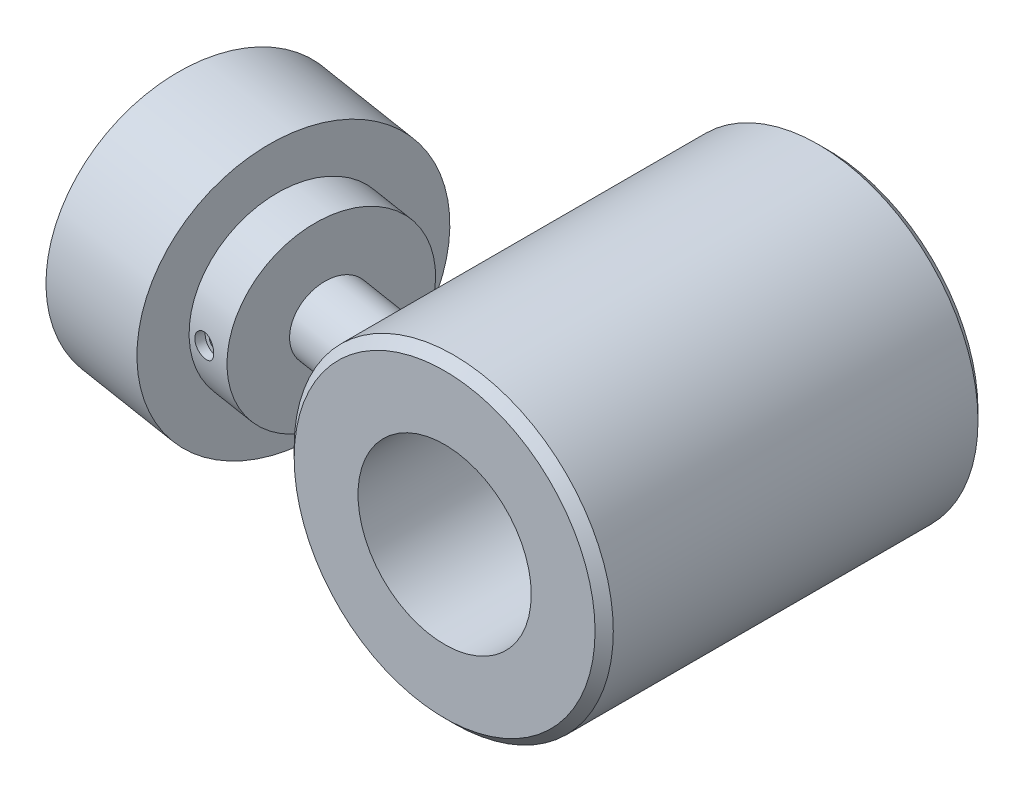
ISO-10303-21;
HEADER;
FILE_DESCRIPTION(('STEP AP214'),'2;1');
FILE_NAME('part.step','',(''),(''),'','','');
FILE_SCHEMA(('AUTOMOTIVE_DESIGN { 1 0 10303 214 1 1 1 1 }'));
ENDSEC;
DATA;
#1=APPLICATION_CONTEXT('core data for automotive mechanical design processes');
#2=APPLICATION_PROTOCOL_DEFINITION('international standard','automotive_design',2000,#1);
#3=PRODUCT_CONTEXT('',#1,'mechanical');
#4=PRODUCT('Part','Part','',(#3));
#5=PRODUCT_RELATED_PRODUCT_CATEGORY('part','',(#4));
#6=PRODUCT_DEFINITION_FORMATION('','',#4);
#7=PRODUCT_DEFINITION_CONTEXT('part definition',#1,'design');
#8=PRODUCT_DEFINITION('design','',#6,#7);
#9=PRODUCT_DEFINITION_SHAPE('','',#8);
#10=(LENGTH_UNIT() NAMED_UNIT(*) SI_UNIT(.MILLI.,.METRE.));
#11=(NAMED_UNIT(*) PLANE_ANGLE_UNIT() SI_UNIT($,.RADIAN.));
#12=(NAMED_UNIT(*) SI_UNIT($,.STERADIAN.) SOLID_ANGLE_UNIT());
#13=UNCERTAINTY_MEASURE_WITH_UNIT(LENGTH_MEASURE(1.E-05),#10,'distance_accuracy_value','');
#14=(GEOMETRIC_REPRESENTATION_CONTEXT(3) GLOBAL_UNCERTAINTY_ASSIGNED_CONTEXT((#13)) GLOBAL_UNIT_ASSIGNED_CONTEXT((#10,
#11,#12)) REPRESENTATION_CONTEXT('',''));
#15=CARTESIAN_POINT('',(0.,0.,0.));
#16=DIRECTION('',(0.,0.,1.));
#17=DIRECTION('',(1.,0.,0.));
#18=AXIS2_PLACEMENT_3D('',#15,#16,#17);
#19=CARTESIAN_POINT('',(-29.0733393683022,0.,17.5547769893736));
#20=DIRECTION('',(-0.156434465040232,0.,0.987688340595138));
#21=DIRECTION('',(-0.987688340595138,0.,-0.156434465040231));
#22=AXIS2_PLACEMENT_3D('',#19,#20,#21);
#23=PLANE('',#22);
#24=CARTESIAN_POINT('',(-29.0733393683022,0.,17.5547769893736));
#25=DIRECTION('',(-0.156434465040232,0.,0.987688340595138));
#26=DIRECTION('',(-0.987688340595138,0.,-0.156434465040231));
#27=AXIS2_PLACEMENT_3D('',#24,#25,#26);
#28=CIRCLE('',#27,0.7);
#29=CARTESIAN_POINT('',(-29.7647212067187,0.,17.4452728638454));
#30=VERTEX_POINT('',#29);
#31=EDGE_CURVE('E9',#30,#30,#28,.T.);
#32=ORIENTED_EDGE('',*,*,#31,.T.);
#33=EDGE_LOOP('',(#32));
#34=FACE_BOUND('',#33,.T.);
#35=CARTESIAN_POINT('',(-29.0733393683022,0.,17.5547769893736));
#36=DIRECTION('',(-0.156434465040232,0.,0.987688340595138));
#37=DIRECTION('',(0.987688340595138,0.,0.156434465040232));
#38=AXIS2_PLACEMENT_3D('',#35,#36,#37);
#39=CIRCLE('',#38,1.25);
#40=CARTESIAN_POINT('',(-27.8387289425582,0.,17.7503200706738));
#41=VERTEX_POINT('',#40);
#42=EDGE_CURVE('E316',#41,#41,#39,.T.);
#43=ORIENTED_EDGE('',*,*,#42,.F.);
#44=EDGE_LOOP('',(#43));
#45=FACE_BOUND('',#44,.T.);
#46=ADVANCED_FACE('F14',(#34,#45),#23,.F.);
#47=CARTESIAN_POINT('',(-29.0733393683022,0.,17.5547769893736));
#48=DIRECTION('',(-0.156434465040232,0.,0.987688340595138));
#49=DIRECTION('',(-0.987688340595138,0.,-0.156434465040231));
#50=AXIS2_PLACEMENT_3D('',#47,#48,#49);
#51=CYLINDRICAL_SURFACE('',#50,0.7);
#52=ORIENTED_EDGE('',*,*,#31,.F.);
#53=EDGE_LOOP('',(#52));
#54=FACE_BOUND('',#53,.T.);
#55=CARTESIAN_POINT('',(-31.8891597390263,0.,35.3331671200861));
#56=DIRECTION('',(-0.156434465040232,0.,0.987688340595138));
#57=DIRECTION('',(-0.987688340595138,0.,-0.156434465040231));
#58=AXIS2_PLACEMENT_3D('',#55,#56,#57);
#59=CIRCLE('',#58,0.7);
#60=CARTESIAN_POINT('',(-32.5805415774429,0.,35.2236629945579));
#61=VERTEX_POINT('',#60);
#62=EDGE_CURVE('E22',#61,#61,#59,.T.);
#63=ORIENTED_EDGE('',*,*,#62,.T.);
#64=EDGE_LOOP('',(#63));
#65=FACE_BOUND('',#64,.T.);
#66=ADVANCED_FACE('F304',(#54,#65),#51,.F.);
#67=CARTESIAN_POINT('',(-31.8891597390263,0.,35.3331671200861));
#68=DIRECTION('',(-0.156434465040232,0.,0.987688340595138));
#69=DIRECTION('',(-0.987688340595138,0.,-0.156434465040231));
#70=AXIS2_PLACEMENT_3D('',#67,#68,#69);
#71=PLANE('',#70);
#72=ORIENTED_EDGE('',*,*,#62,.F.);
#73=EDGE_LOOP('',(#72));
#74=FACE_BOUND('',#73,.T.);
#75=CARTESIAN_POINT('',(-31.8891597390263,0.,35.3331671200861));
#76=DIRECTION('',(-0.156434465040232,0.,0.987688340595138));
#77=DIRECTION('',(0.987688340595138,0.,0.156434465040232));
#78=AXIS2_PLACEMENT_3D('',#75,#76,#77);
#79=CIRCLE('',#78,1.24999999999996);
#80=CARTESIAN_POINT('',(-30.6545493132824,0.,35.5287102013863));
#81=VERTEX_POINT('',#80);
#82=EDGE_CURVE('E318',#81,#81,#79,.F.);
#83=ORIENTED_EDGE('',*,*,#82,.F.);
#84=EDGE_LOOP('',(#83));
#85=FACE_BOUND('',#84,.T.);
#86=ADVANCED_FACE('F310',(#74,#85),#71,.T.);
#87=CARTESIAN_POINT('',(-31.1069874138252,0.,30.3947254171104));
#88=DIRECTION('',(0.156434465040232,0.,-0.987688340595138));
#89=DIRECTION('',(0.987688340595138,0.,0.156434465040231));
#90=AXIS2_PLACEMENT_3D('',#87,#88,#89);
#91=CYLINDRICAL_SURFACE('',#90,1.25);
#92=CARTESIAN_POINT('',(-30.1515153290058,0.,16.3715455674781));
#93=CARTESIAN_POINT('',(-30.1515125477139,-0.0699205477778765,16.3715469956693));
#94=CARTESIAN_POINT('',(-30.1458172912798,-0.139884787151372,16.3731983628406));
#95=CARTESIAN_POINT('',(-30.1231783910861,-0.277866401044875,16.3797011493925));
#96=CARTESIAN_POINT('',(-30.1062230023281,-0.345881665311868,16.384555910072));
#97=CARTESIAN_POINT('',(-30.0615434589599,-0.477947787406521,16.3971451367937));
#98=CARTESIAN_POINT('',(-30.0338265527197,-0.542001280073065,16.4048776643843));
#99=CARTESIAN_POINT('',(-29.9683840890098,-0.664389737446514,16.4227302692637));
#100=CARTESIAN_POINT('',(-29.9306602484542,-0.72272568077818,16.432849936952));
#101=CARTESIAN_POINT('',(-29.8459995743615,-0.832356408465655,16.4549135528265));
#102=CARTESIAN_POINT('',(-29.7990183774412,-0.883615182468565,16.4668662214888));
#103=CARTESIAN_POINT('',(-29.6972115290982,-0.977326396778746,16.4918569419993));
#104=CARTESIAN_POINT('',(-29.6423854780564,-1.01977838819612,16.504895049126));
#105=CARTESIAN_POINT('',(-29.5261596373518,-1.09480508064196,16.531379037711));
#106=CARTESIAN_POINT('',(-29.4647383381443,-1.12734604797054,16.544826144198));
#107=CARTESIAN_POINT('',(-29.3371588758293,-1.18141153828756,16.5713938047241));
#108=CARTESIAN_POINT('',(-29.2710008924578,-1.2029364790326,16.5845143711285));
#109=CARTESIAN_POINT('',(-29.1361580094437,-1.23424949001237,16.6097636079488));
#110=CARTESIAN_POINT('',(-29.0674881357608,-1.24409835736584,16.6218971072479));
#111=CARTESIAN_POINT('',(-28.9292495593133,-1.25196777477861,16.6447940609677));
#112=CARTESIAN_POINT('',(-28.8596808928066,-1.2499888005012,16.6555575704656));
#113=CARTESIAN_POINT('',(-28.7220423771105,-1.23430861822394,16.6753702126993));
#114=CARTESIAN_POINT('',(-28.6539662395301,-1.22067438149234,16.684428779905));
#115=CARTESIAN_POINT('',(-28.5208476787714,-1.18217519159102,16.7007958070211));
#116=CARTESIAN_POINT('',(-28.4558053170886,-1.15731001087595,16.708104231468));
#117=CARTESIAN_POINT('',(-28.3304326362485,-1.09698277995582,16.7210328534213));
#118=CARTESIAN_POINT('',(-28.2701158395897,-1.06149162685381,16.7266483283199));
#119=CARTESIAN_POINT('',(-28.1561106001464,-0.980940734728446,16.7363332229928));
#120=CARTESIAN_POINT('',(-28.1024224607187,-0.93588055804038,16.7404025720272));
#121=CARTESIAN_POINT('',(-28.002866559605,-0.837099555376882,16.747268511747));
#122=CARTESIAN_POINT('',(-27.9570554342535,-0.783321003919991,16.7500561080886));
#123=CARTESIAN_POINT('',(-27.8750576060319,-0.668828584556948,16.7546049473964));
#124=CARTESIAN_POINT('',(-27.8388709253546,-0.60811470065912,16.7563661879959));
#125=CARTESIAN_POINT('',(-27.7772004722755,-0.481430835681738,16.7591363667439));
#126=CARTESIAN_POINT('',(-27.7517202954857,-0.415459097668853,16.7601450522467));
#127=CARTESIAN_POINT('',(-27.7122709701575,-0.28015397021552,16.76162606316));
#128=CARTESIAN_POINT('',(-27.6983012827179,-0.210820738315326,16.762098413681));
#129=CARTESIAN_POINT('',(-27.6823667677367,-0.0712565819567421,16.7626324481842));
#130=CARTESIAN_POINT('',(-27.6803223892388,-0.00103474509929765,16.7626968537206));
#131=CARTESIAN_POINT('',(-27.6880898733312,0.138748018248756,16.7624410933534));
#132=CARTESIAN_POINT('',(-27.6979014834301,0.208308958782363,16.7621209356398));
#133=CARTESIAN_POINT('',(-27.7290206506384,0.344562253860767,16.7610083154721));
#134=CARTESIAN_POINT('',(-27.7502903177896,0.411263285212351,16.7602174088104));
#135=CARTESIAN_POINT('',(-27.8036498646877,0.540174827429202,16.7579816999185));
#136=CARTESIAN_POINT('',(-27.8357401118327,0.602385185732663,16.7565368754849));
#137=CARTESIAN_POINT('',(-27.9099757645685,0.720902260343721,16.7527335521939));
#138=CARTESIAN_POINT('',(-27.952172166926,0.777176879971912,16.7503703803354));
#139=CARTESIAN_POINT('',(-28.0452935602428,0.881898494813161,16.7444465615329));
#140=CARTESIAN_POINT('',(-28.0962188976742,0.930345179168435,16.7408858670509));
#141=CARTESIAN_POINT('',(-28.2056422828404,1.01831597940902,16.7322728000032));
#142=CARTESIAN_POINT('',(-28.2641817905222,1.05778773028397,16.7272120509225));
#143=CARTESIAN_POINT('',(-28.3869094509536,1.12632644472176,16.7153970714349));
#144=CARTESIAN_POINT('',(-28.4510974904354,1.15539361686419,16.7086428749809));
#145=CARTESIAN_POINT('',(-28.5830866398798,1.20221328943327,16.6933647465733));
#146=CARTESIAN_POINT('',(-28.6508778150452,1.21999531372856,16.6848455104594));
#147=CARTESIAN_POINT('',(-28.7882583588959,1.24383499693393,16.6660826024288));
#148=CARTESIAN_POINT('',(-28.8578476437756,1.24989320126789,16.6558390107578));
#149=CARTESIAN_POINT('',(-28.9963239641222,1.25010326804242,16.6339333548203));
#150=CARTESIAN_POINT('',(-29.0652125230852,1.24433739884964,16.6222816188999));
#151=CARTESIAN_POINT('',(-29.2008235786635,1.22123720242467,16.5978977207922));
#152=CARTESIAN_POINT('',(-29.2675460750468,1.20390287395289,16.5851655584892));
#153=CARTESIAN_POINT('',(-29.3969490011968,1.15818353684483,16.5591650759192));
#154=CARTESIAN_POINT('',(-29.4596308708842,1.12980249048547,16.5458969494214));
#155=CARTESIAN_POINT('',(-29.5792831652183,1.06280345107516,16.5194646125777));
#156=CARTESIAN_POINT('',(-29.6362535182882,1.0241853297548,16.506300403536));
#157=CARTESIAN_POINT('',(-29.7433295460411,0.937503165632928,16.480690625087));
#158=CARTESIAN_POINT('',(-29.7933868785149,0.889377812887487,16.4682504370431));
#159=CARTESIAN_POINT('',(-29.8848607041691,0.785175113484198,16.4448984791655));
#160=CARTESIAN_POINT('',(-29.9262751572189,0.729095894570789,16.4339870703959));
#161=CARTESIAN_POINT('',(-29.9994776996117,0.610332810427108,16.4143208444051));
#162=CARTESIAN_POINT('',(-30.0312285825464,0.547624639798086,16.4055743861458));
#163=CARTESIAN_POINT('',(-30.0839907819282,0.417591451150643,16.3908582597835));
#164=CARTESIAN_POINT('',(-30.1050137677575,0.350271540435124,16.3848855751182));
#165=CARTESIAN_POINT('',(-30.1307264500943,0.235502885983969,16.3775378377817));
#166=CARTESIAN_POINT('',(-30.1385116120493,0.188777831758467,16.375297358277));
#167=CARTESIAN_POINT('',(-30.1489069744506,0.0947085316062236,16.3723007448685));
#168=CARTESIAN_POINT('',(-30.1515172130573,0.0473642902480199,16.3715446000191));
#169=CARTESIAN_POINT('',(-30.1515153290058,0.,16.3715455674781));
#170=B_SPLINE_CURVE_WITH_KNOTS('',3,(#92,#93,#94,#95,#96,#97,#98,#99,#100,#101,#102,#103,#104,
#105,#106,#107,#108,#109,#110,#111,#112,#113,#114,#115,#116,#117,#118,#119,#120,#121,#122,#123,
#124,#125,#126,#127,#128,#129,#130,#131,#132,#133,#134,#135,#136,#137,#138,#139,#140,#141,#142,
#143,#144,#145,#146,#147,#148,#149,#150,#151,#152,#153,#154,#155,#156,#157,#158,#159,#160,#161,
#162,#163,#164,#165,#166,#167,#168,#169),.UNSPECIFIED.,.T.,.F.,(4,2,2,2,2,2,2,2,2,2,2,2,2,2,2,2,
2,2,2,2,2,2,2,2,2,2,2,2,2,2,2,2,2,2,2,2,2,2,4),(0.,0.209588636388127,0.419396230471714,
0.629062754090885,0.838693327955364,1.04935406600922,1.26002553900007,1.47140625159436,
1.68277894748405,1.8930461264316,2.10330484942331,2.31236348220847,2.52142635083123,
2.73106713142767,2.94071750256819,3.15181739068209,3.36291776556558,3.57408897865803,
3.7852503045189,3.99500139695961,4.20474802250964,4.41380526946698,4.62286961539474,
4.83301201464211,5.04316275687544,5.25450985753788,5.46585272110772,5.67664037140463,
5.8874182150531,6.09673450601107,6.30605081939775,6.51529212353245,6.72453604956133,
6.93517618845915,7.14586599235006,7.35735701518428,7.56861749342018,7.71059421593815,
7.85256989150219),.UNSPECIFIED.);
#171=CARTESIAN_POINT('',(-30.1515153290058,0.,16.3715455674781));
#172=VERTEX_POINT('',#171);
#173=EDGE_CURVE('E195',#172,#172,#170,.T.);
#174=ORIENTED_EDGE('',*,*,#173,.F.);
#175=EDGE_LOOP('',(#174));
#176=FACE_BOUND('',#175,.T.);
#177=ORIENTED_EDGE('',*,*,#42,.T.);
#178=EDGE_LOOP('',(#177));
#179=FACE_BOUND('',#178,.T.);
#180=ADVANCED_FACE('F215',(#176,#179),#91,.F.);
#181=CARTESIAN_POINT('',(-37.1481458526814,0.,25.3880394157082));
#182=DIRECTION('',(0.987688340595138,0.,0.156434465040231));
#183=DIRECTION('',(-0.156434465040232,0.,0.987688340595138));
#184=AXIS2_PLACEMENT_3D('',#181,#182,#183);
#185=CYLINDRICAL_SURFACE('',#184,4.);
#186=CARTESIAN_POINT('',(-17.5,0.,32.549860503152));
#187=CARTESIAN_POINT('',(-17.4999957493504,0.224614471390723,32.5498539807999));
#188=CARTESIAN_POINT('',(-17.4956327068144,0.449318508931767,32.5313396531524));
#189=CARTESIAN_POINT('',(-17.4786392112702,0.892435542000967,32.4577221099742));
#190=CARTESIAN_POINT('',(-17.466003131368,1.11084415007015,32.4025939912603));
#191=CARTESIAN_POINT('',(-17.4338463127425,1.53500330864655,32.2571782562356));
#192=CARTESIAN_POINT('',(-17.4143281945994,1.74075864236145,32.1669040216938));
#193=CARTESIAN_POINT('',(-17.3705421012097,2.13387663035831,31.9534994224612));
#194=CARTESIAN_POINT('',(-17.3462746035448,2.32124113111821,31.8303723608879));
#195=CARTESIAN_POINT('',(-17.2956371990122,2.67254969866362,31.554214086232));
#196=CARTESIAN_POINT('',(-17.2692645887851,2.83646287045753,31.4011440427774));
#197=CARTESIAN_POINT('',(-17.2174178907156,3.13586762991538,31.0692182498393));
#198=CARTESIAN_POINT('',(-17.1919437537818,3.27136077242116,30.890363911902));
#199=CARTESIAN_POINT('',(-17.1450047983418,3.50904954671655,30.5132847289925));
#200=CARTESIAN_POINT('',(-17.1235096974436,3.61150148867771,30.3152252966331));
#201=CARTESIAN_POINT('',(-17.0867315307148,3.78169775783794,29.9041969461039));
#202=CARTESIAN_POINT('',(-17.071447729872,3.84944619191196,29.6912297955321));
#203=CARTESIAN_POINT('',(-17.0489280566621,3.94798646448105,29.2592561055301));
#204=CARTESIAN_POINT('',(-17.0415966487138,3.9792173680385,29.0403543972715));
#205=CARTESIAN_POINT('',(-17.0353528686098,4.00586319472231,28.6002825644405));
#206=CARTESIAN_POINT('',(-17.0364409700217,4.0012761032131,28.3791123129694));
#207=CARTESIAN_POINT('',(-17.0468237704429,3.95680559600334,27.9380003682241));
#208=CARTESIAN_POINT('',(-17.0562129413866,3.91651584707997,27.7181022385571));
#209=CARTESIAN_POINT('',(-17.0821528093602,3.80177307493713,27.287851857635));
#210=CARTESIAN_POINT('',(-17.0987051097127,3.72731240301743,27.0775017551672));
#211=CARTESIAN_POINT('',(-17.1378795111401,3.54292035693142,26.6635686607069));
#212=CARTESIAN_POINT('',(-17.1607139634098,3.43171388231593,26.460573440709));
#213=CARTESIAN_POINT('',(-17.2095501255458,3.17774497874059,26.0757614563));
#214=CARTESIAN_POINT('',(-17.2355525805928,3.03497511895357,25.8939496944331));
#215=CARTESIAN_POINT('',(-17.2885137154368,2.71731655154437,25.5523458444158));
#216=CARTESIAN_POINT('',(-17.3154801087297,2.54171848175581,25.3932124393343));
#217=CARTESIAN_POINT('',(-17.3665728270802,2.16521302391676,25.1077562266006));
#218=CARTESIAN_POINT('',(-17.3906996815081,1.96431036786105,24.9814272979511));
#219=CARTESIAN_POINT('',(-17.4324970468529,1.54923721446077,24.7698430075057));
#220=CARTESIAN_POINT('',(-17.4503460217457,1.33567891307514,24.6834256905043));
#221=CARTESIAN_POINT('',(-17.4784212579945,0.896184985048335,24.5497264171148));
#222=CARTESIAN_POINT('',(-17.4886512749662,0.670255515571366,24.5024251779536));
#223=CARTESIAN_POINT('',(-17.4998301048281,0.227725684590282,24.4508532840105));
#224=CARTESIAN_POINT('',(-17.5013210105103,0.0114294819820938,24.4440688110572));
#225=CARTESIAN_POINT('',(-17.4963048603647,-0.419085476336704,24.4671089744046));
#226=CARTESIAN_POINT('',(-17.489799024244,-0.63330454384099,24.4969280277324));
#227=CARTESIAN_POINT('',(-17.4697946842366,-1.04801423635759,24.5906483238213));
#228=CARTESIAN_POINT('',(-17.4564779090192,-1.24871532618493,24.6536650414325));
#229=CARTESIAN_POINT('',(-17.4243532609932,-1.63704573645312,24.8108094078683));
#230=CARTESIAN_POINT('',(-17.4055445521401,-1.8246730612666,24.9049417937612));
#231=CARTESIAN_POINT('',(-17.3635294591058,-2.18924524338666,25.1252195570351));
#232=CARTESIAN_POINT('',(-17.3401852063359,-2.3655305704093,25.2524280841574));
#233=CARTESIAN_POINT('',(-17.2919524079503,-2.69560016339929,25.5330478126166));
#234=CARTESIAN_POINT('',(-17.2670633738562,-2.84937725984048,25.6864673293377));
#235=CARTESIAN_POINT('',(-17.2166804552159,-3.13990421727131,26.0255416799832));
#236=CARTESIAN_POINT('',(-17.1912429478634,-3.27503349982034,26.2125956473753));
#237=CARTESIAN_POINT('',(-17.144170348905,-3.51314694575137,26.6066225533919));
#238=CARTESIAN_POINT('',(-17.1225360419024,-3.61612447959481,26.8135995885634));
#239=CARTESIAN_POINT('',(-17.0850498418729,-3.78935161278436,27.2478052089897));
#240=CARTESIAN_POINT('',(-17.0693664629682,-3.85866112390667,27.4754252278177));
#241=CARTESIAN_POINT('',(-17.046655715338,-3.95779784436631,27.9395346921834));
#242=CARTESIAN_POINT('',(-17.0396266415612,-3.98763283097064,28.176022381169));
#243=CARTESIAN_POINT('',(-17.0353470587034,-4.00587500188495,28.6441743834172));
#244=CARTESIAN_POINT('',(-17.0378324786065,-3.9954009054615,28.875792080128));
#245=CARTESIAN_POINT('',(-17.0518556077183,-3.93512027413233,29.3335629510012));
#246=CARTESIAN_POINT('',(-17.0633912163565,-3.88532286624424,29.5597173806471));
#247=CARTESIAN_POINT('',(-17.0936083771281,-3.75008091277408,29.9911728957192));
#248=CARTESIAN_POINT('',(-17.1120042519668,-3.66605044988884,30.1969386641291));
#249=CARTESIAN_POINT('',(-17.1538823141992,-3.46479928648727,30.5909656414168));
#250=CARTESIAN_POINT('',(-17.1773642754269,-3.34758006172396,30.7792276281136));
#251=CARTESIAN_POINT('',(-17.2266034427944,-3.08413874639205,31.1318911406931));
#252=CARTESIAN_POINT('',(-17.2523445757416,-2.93811357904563,31.2964422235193));
#253=CARTESIAN_POINT('',(-17.3034160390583,-2.62061004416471,31.598945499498));
#254=CARTESIAN_POINT('',(-17.3287462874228,-2.44912666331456,31.7368924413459));
#255=CARTESIAN_POINT('',(-17.3765824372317,-2.08299901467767,31.9843622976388));
#256=CARTESIAN_POINT('',(-17.3990460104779,-1.88807553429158,32.0934801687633));
#257=CARTESIAN_POINT('',(-17.4382827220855,-1.48246254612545,32.2780292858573));
#258=CARTESIAN_POINT('',(-17.4550595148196,-1.27178326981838,32.3534821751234));
#259=CARTESIAN_POINT('',(-17.4784899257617,-0.884370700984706,32.4571671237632));
#260=CARTESIAN_POINT('',(-17.4865066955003,-0.709420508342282,32.491873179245));
#261=CARTESIAN_POINT('',(-17.4972634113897,-0.356332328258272,32.5382224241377));
#262=CARTESIAN_POINT('',(-17.5000033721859,-0.178194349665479,32.5498656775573));
#263=CARTESIAN_POINT('',(-17.5,0.,32.549860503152));
#264=B_SPLINE_CURVE_WITH_KNOTS('',3,(#186,#187,#188,#189,#190,#191,#192,#193,#194,#195,#196,
#197,#198,#199,#200,#201,#202,#203,#204,#205,#206,#207,#208,#209,#210,#211,#212,#213,#214,#215,
#216,#217,#218,#219,#220,#221,#222,#223,#224,#225,#226,#227,#228,#229,#230,#231,#232,#233,#234,
#235,#236,#237,#238,#239,#240,#241,#242,#243,#244,#245,#246,#247,#248,#249,#250,#251,#252,#253,
#254,#255,#256,#257,#258,#259,#260,#261,#262,#263),.UNSPECIFIED.,.T.,.F.,(4,2,2,2,2,2,2,2,2,2,2,
2,2,2,2,2,2,2,2,2,2,2,2,2,2,2,2,2,2,2,2,2,2,2,2,2,2,2,4),(0.,0.673201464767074,1.34686128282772,
2.02026485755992,2.6936007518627,3.36781569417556,4.04199374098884,4.71080864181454,
5.37954437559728,6.0401541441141,6.70080106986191,7.36906481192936,8.03747820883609,
8.73207239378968,9.42683027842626,10.1388354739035,10.8507077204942,11.5402958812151,
12.2295438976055,12.8755434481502,13.5214444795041,14.150946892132,14.7805451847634,
15.433628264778,16.0869189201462,16.7802373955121,17.4736987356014,18.1855455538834,
18.8972521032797,19.5893506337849,20.2812885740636,20.9471508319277,21.61298348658,
22.2744129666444,22.9359728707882,23.6063851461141,24.2763657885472,24.8104410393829,
25.3445148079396),.UNSPECIFIED.);
#265=CARTESIAN_POINT('',(-17.5,0.,32.549860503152));
#266=VERTEX_POINT('',#265);
#267=EDGE_CURVE('E187',#266,#266,#264,.T.);
#268=ORIENTED_EDGE('',*,*,#267,.T.);
#269=EDGE_LOOP('',(#268));
#270=FACE_BOUND('',#269,.T.);
#271=CARTESIAN_POINT('',(-27.5181845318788,0.,26.9132754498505));
#272=DIRECTION('',(-0.987688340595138,0.,-0.156434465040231));
#273=DIRECTION('',(0.,1.,0.));
#274=AXIS2_PLACEMENT_3D('',#271,#272,#273);
#275=CIRCLE('',#274,4.);
#276=CARTESIAN_POINT('',(-27.5181845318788,4.00000000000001,26.9132754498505));
#277=VERTEX_POINT('',#276);
#278=EDGE_CURVE('E184',#277,#277,#275,.T.);
#279=ORIENTED_EDGE('',*,*,#278,.F.);
#280=EDGE_LOOP('',(#279));
#281=FACE_BOUND('',#280,.T.);
#282=ADVANCED_FACE('F209',(#270,#281),#185,.T.);
#283=ORIENTED_EDGE('',*,*,#82,.T.);
#284=EDGE_LOOP('',(#283));
#285=FACE_BOUND('',#284,.T.);
#286=CARTESIAN_POINT('',(-33.2802046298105,0.,36.1253123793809));
#287=CARTESIAN_POINT('',(-33.2802015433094,0.0699205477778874,36.1253118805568));
#288=CARTESIAN_POINT('',(-33.2742747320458,0.139884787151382,36.1255012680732));
#289=CARTESIAN_POINT('',(-33.2507343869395,0.277866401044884,36.1263125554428));
#290=CARTESIAN_POINT('',(-33.2331086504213,0.345881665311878,36.1269349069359));
#291=CARTESIAN_POINT('',(-33.1867255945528,0.477947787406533,36.1287685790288));
#292=CARTESIAN_POINT('',(-33.1579757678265,0.542001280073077,36.129979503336));
#293=CARTESIAN_POINT('',(-33.0902195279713,0.664389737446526,36.1332235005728));
#294=CARTESIAN_POINT('',(-33.051214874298,0.722725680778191,36.1352564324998));
#295=CARTESIAN_POINT('',(-32.9638797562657,0.832356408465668,36.1404342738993));
#296=CARTESIAN_POINT('',(-32.9155044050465,0.883615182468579,36.1435845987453));
#297=CARTESIAN_POINT('',(-32.810957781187,0.977326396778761,36.1512770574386));
#298=CARTESIAN_POINT('',(-32.7547861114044,1.01977838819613,36.1558192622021));
#299=CARTESIAN_POINT('',(-32.6360647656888,1.09480508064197,36.166547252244));
#300=CARTESIAN_POINT('',(-32.5734942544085,1.12734604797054,36.172738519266));
#301=CARTESIAN_POINT('',(-32.443949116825,1.18141153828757,36.1868953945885));
#302=CARTESIAN_POINT('',(-32.3769746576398,1.20293647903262,36.1948609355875));
#303=CARTESIAN_POINT('',(-32.2409290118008,1.23424949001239,36.2125162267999));
#304=CARTESIAN_POINT('',(-32.1718706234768,1.24409835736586,36.2221967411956));
#305=CARTESIAN_POINT('',(-32.0333223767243,1.25196777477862,36.2431385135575));
#306=CARTESIAN_POINT('',(-31.9638325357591,1.24998880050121,36.2543997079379));
#307=CARTESIAN_POINT('',(-31.8268080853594,1.23430861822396,36.2780894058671));
#308=CARTESIAN_POINT('',(-31.7592645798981,1.22067438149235,36.2905108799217));
#309=CARTESIAN_POINT('',(-31.6276036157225,1.18217519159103,36.3160808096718));
#310=CARTESIAN_POINT('',(-31.5634862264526,1.15731001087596,36.329229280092));
#311=CARTESIAN_POINT('',(-31.4402545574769,1.09698277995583,36.3556757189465));
#312=CARTESIAN_POINT('',(-31.3811545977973,1.06149162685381,36.3689740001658));
#313=CARTESIAN_POINT('',(-31.2697363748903,0.98094073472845,36.3949926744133));
#314=CARTESIAN_POINT('',(-31.2174184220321,0.935880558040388,36.4077130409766));
#315=CARTESIAN_POINT('',(-31.1206134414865,0.837099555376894,36.4319476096));
#316=CARTESIAN_POINT('',(-31.0761830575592,0.783321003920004,36.4434528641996));
#317=CARTESIAN_POINT('',(-30.9967928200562,0.668828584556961,36.4644653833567));
#318=CARTESIAN_POINT('',(-30.9618329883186,0.608114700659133,36.4739726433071));
#319=CARTESIAN_POINT('',(-30.9023248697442,0.481430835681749,36.4903952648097));
#320=CARTESIAN_POINT('',(-30.8777800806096,0.415459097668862,36.4973097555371));
#321=CARTESIAN_POINT('',(-30.8398038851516,0.280153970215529,36.5080917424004));
#322=CARTESIAN_POINT('',(-30.8263719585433,0.210820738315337,36.5119593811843));
#323=CARTESIAN_POINT('',(-30.8110523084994,0.0712565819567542,36.5163755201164));
#324=CARTESIAN_POINT('',(-30.8090880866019,0.00103474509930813,36.5169460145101));
#325=CARTESIAN_POINT('',(-30.8165544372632,-0.138748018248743,36.5147889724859));
#326=CARTESIAN_POINT('',(-30.8259847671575,-0.208308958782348,36.5120615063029));
#327=CARTESIAN_POINT('',(-30.8559246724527,-0.344562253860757,36.5035033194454));
#328=CARTESIAN_POINT('',(-30.8763977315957,-0.41126328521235,36.4976828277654));
#329=CARTESIAN_POINT('',(-30.9278365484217,-0.5401748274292,36.4833201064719));
#330=CARTESIAN_POINT('',(-30.9588026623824,-0.602385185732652,36.4747777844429));
#331=CARTESIAN_POINT('',(-31.0305802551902,-0.72090226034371,36.4554548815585));
#332=CARTESIAN_POINT('',(-31.0714416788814,-0.77717687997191,36.4446629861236));
#333=CARTESIAN_POINT('',(-31.1618359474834,-0.881898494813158,36.4215207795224));
#334=CARTESIAN_POINT('',(-31.2113691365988,-0.930345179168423,36.4091704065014));
#335=CARTESIAN_POINT('',(-31.3180985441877,-1.018315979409,36.383548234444));
#336=CARTESIAN_POINT('',(-31.3753367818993,-1.05778773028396,36.3702715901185));
#337=CARTESIAN_POINT('',(-31.4957087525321,-1.12632644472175,36.343583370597));
#338=CARTESIAN_POINT('',(-31.5588423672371,-1.15539361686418,36.3301717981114));
#339=CARTESIAN_POINT('',(-31.6890927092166,-1.20221328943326,36.3039152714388));
#340=CARTESIAN_POINT('',(-31.7561985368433,-1.21999531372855,36.291068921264));
#341=CARTESIAN_POINT('',(-31.8926532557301,-1.24383499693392,36.2664605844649));
#342=CARTESIAN_POINT('',(-31.962002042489,-1.24989320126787,36.2546985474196));
#343=CARTESIAN_POINT('',(-32.1004700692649,-1.25010326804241,36.2327405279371));
#344=CARTESIAN_POINT('',(-32.1695875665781,-1.24433739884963,36.2225342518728));
#345=CARTESIAN_POINT('',(-32.3060963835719,-1.22123720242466,36.2038185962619));
#346=CARTESIAN_POINT('',(-32.3734877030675,-1.20390287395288,36.1953092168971));
#347=CARTESIAN_POINT('',(-32.5045917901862,-1.15818353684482,36.18004944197));
#348=CARTESIAN_POINT('',(-32.5683058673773,-1.12980249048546,36.1732984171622));
#349=CARTESIAN_POINT('',(-32.6902700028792,-1.06280345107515,36.161462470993));
#350=CARTESIAN_POINT('',(-32.7485199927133,-1.02418532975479,36.1563775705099));
#351=CARTESIAN_POINT('',(-32.8582692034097,-0.937503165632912,36.1476456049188));
#352=CARTESIAN_POINT('',(-32.909720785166,-0.889377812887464,36.1440083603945));
#353=CARTESIAN_POINT('',(-33.0039337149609,-0.785175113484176,36.1379504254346));
#354=CARTESIAN_POINT('',(-33.0466930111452,-0.729095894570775,36.1355300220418));
#355=CARTESIAN_POINT('',(-33.1223899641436,-0.610332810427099,36.1316128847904));
#356=CARTESIAN_POINT('',(-33.1552896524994,-0.547624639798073,36.1301196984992));
#357=CARTESIAN_POINT('',(-33.2100170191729,-0.417591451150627,36.1278111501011));
#358=CARTESIAN_POINT('',(-33.2318567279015,-0.35027154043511,36.126995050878));
#359=CARTESIAN_POINT('',(-33.2585815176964,-0.235502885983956,36.1260375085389));
#360=CARTESIAN_POINT('',(-33.2666779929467,-0.188777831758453,36.1257625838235));
#361=CARTESIAN_POINT('',(-33.2774905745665,-0.0947085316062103,36.1254001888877));
#362=CARTESIAN_POINT('',(-33.2802067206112,-0.0473642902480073,36.1253127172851));
#363=CARTESIAN_POINT('',(-33.2802046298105,0.,36.1253123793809));
#364=B_SPLINE_CURVE_WITH_KNOTS('',3,(#286,#287,#288,#289,#290,#291,#292,#293,#294,#295,#296,
#297,#298,#299,#300,#301,#302,#303,#304,#305,#306,#307,#308,#309,#310,#311,#312,#313,#314,#315,
#316,#317,#318,#319,#320,#321,#322,#323,#324,#325,#326,#327,#328,#329,#330,#331,#332,#333,#334,
#335,#336,#337,#338,#339,#340,#341,#342,#343,#344,#345,#346,#347,#348,#349,#350,#351,#352,#353,
#354,#355,#356,#357,#358,#359,#360,#361,#362,#363),.UNSPECIFIED.,.T.,.F.,(4,2,2,2,2,2,2,2,2,2,2,
2,2,2,2,2,2,2,2,2,2,2,2,2,2,2,2,2,2,2,2,2,2,2,2,2,2,2,4),(0.,0.209588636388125,
0.419396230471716,0.629062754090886,0.838693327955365,1.04935406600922,1.26002553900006,
1.47140625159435,1.68277894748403,1.89304612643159,2.1033048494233,2.31236348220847,
2.52142635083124,2.73106713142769,2.94071750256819,3.15181739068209,3.36291776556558,
3.57408897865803,3.7852503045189,3.99500139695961,4.20474802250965,4.41380526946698,
4.62286961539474,4.83301201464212,5.04316275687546,5.25450985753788,5.4658527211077,
5.67664037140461,5.88741821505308,6.09673450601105,6.30605081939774,6.51529212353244,
6.72453604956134,6.93517618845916,7.14586599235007,7.35735701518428,7.56861749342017,
7.71059421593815,7.85256989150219),.UNSPECIFIED.);
#365=CARTESIAN_POINT('',(-33.2802046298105,0.,36.1253123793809));
#366=VERTEX_POINT('',#365);
#367=EDGE_CURVE('E183',#366,#366,#364,.T.);
#368=ORIENTED_EDGE('',*,*,#367,.F.);
#369=EDGE_LOOP('',(#368));
#370=FACE_BOUND('',#369,.T.);
#371=ADVANCED_FACE('F214',(#285,#370),#91,.F.);
#372=CARTESIAN_POINT('',(-35.5515849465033,0.,29.6907703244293));
#373=DIRECTION('',(-0.987688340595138,0.,-0.156434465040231));
#374=DIRECTION('',(0.156434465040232,0.,-0.987688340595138));
#375=AXIS2_PLACEMENT_3D('',#372,#373,#374);
#376=PLANE('',#375);
#377=DIRECTION('',(0.135476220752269,0.5,-0.855363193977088));
#378=VECTOR('',#377,1.);
#379=CARTESIAN_POINT('',(-35.2387160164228,1.15470053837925,27.7153936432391));
#380=LINE('',#379,#378);
#381=CARTESIAN_POINT('',(-35.2387160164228,1.15470053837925,27.7153936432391));
#382=VERTEX_POINT('',#381);
#383=CARTESIAN_POINT('',(-34.9258470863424,2.3094010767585,25.7400169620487));
#384=VERTEX_POINT('',#383);
#385=EDGE_CURVE('E421',#382,#384,#380,.T.);
#386=ORIENTED_EDGE('',*,*,#385,.T.);
#387=DIRECTION('',(-0.135476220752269,0.5,0.855363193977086));
#388=VECTOR('',#387,1.);
#389=CARTESIAN_POINT('',(-34.6129781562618,1.15470053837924,23.7646402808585));
#390=LINE('',#389,#388);
#391=CARTESIAN_POINT('',(-34.6129781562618,1.15470053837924,23.7646402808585));
#392=VERTEX_POINT('',#391);
#393=EDGE_CURVE('E434',#392,#384,#390,.T.);
#394=ORIENTED_EDGE('',*,*,#393,.F.);
#395=DIRECTION('',(0.,1.,0.));
#396=VECTOR('',#395,1.);
#397=CARTESIAN_POINT('',(-34.6129781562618,-1.15470053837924,23.7646402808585));
#398=LINE('',#397,#396);
#399=CARTESIAN_POINT('',(-34.6129781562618,-1.15470053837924,23.7646402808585));
#400=VERTEX_POINT('',#399);
#401=EDGE_CURVE('E429',#400,#392,#398,.T.);
#402=ORIENTED_EDGE('',*,*,#401,.F.);
#403=DIRECTION('',(-0.135476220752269,-0.5,0.855363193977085));
#404=VECTOR('',#403,1.);
#405=CARTESIAN_POINT('',(-34.6129781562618,-1.15470053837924,23.7646402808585));
#406=LINE('',#405,#404);
#407=CARTESIAN_POINT('',(-34.9258470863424,-2.30940107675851,25.7400169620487));
#408=VERTEX_POINT('',#407);
#409=EDGE_CURVE('E426',#400,#408,#406,.T.);
#410=ORIENTED_EDGE('',*,*,#409,.T.);
#411=DIRECTION('',(0.135476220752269,-0.5,-0.855363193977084));
#412=VECTOR('',#411,1.);
#413=CARTESIAN_POINT('',(-35.2387160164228,-1.15470053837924,27.7153936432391));
#414=LINE('',#413,#412);
#415=CARTESIAN_POINT('',(-35.2387160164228,-1.15470053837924,27.7153936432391));
#416=VERTEX_POINT('',#415);
#417=EDGE_CURVE('E422',#416,#408,#414,.T.);
#418=ORIENTED_EDGE('',*,*,#417,.F.);
#419=DIRECTION('',(0.,1.,0.));
#420=VECTOR('',#419,1.);
#421=CARTESIAN_POINT('',(-35.2387160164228,-1.15470053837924,27.7153936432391));
#422=LINE('',#421,#420);
#423=EDGE_CURVE('E425',#416,#382,#422,.T.);
#424=ORIENTED_EDGE('',*,*,#423,.T.);
#425=EDGE_LOOP('',(#386,#394,#402,#410,#418,#424));
#426=FACE_BOUND('',#425,.T.);
#427=ADVANCED_FACE('F337',(#426),#376,.T.);
#428=CARTESIAN_POINT('',(-34.6129781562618,-1.15470053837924,23.7646402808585));
#429=DIRECTION('',(-0.156434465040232,0.,0.987688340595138));
#430=DIRECTION('',(-0.987688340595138,0.,-0.156434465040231));
#431=AXIS2_PLACEMENT_3D('',#428,#429,#430);
#432=PLANE('',#431);
#433=DIRECTION('',(-0.987688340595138,0.,-0.156434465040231));
#434=VECTOR('',#433,1.);
#435=CARTESIAN_POINT('',(-34.6129781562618,1.15470053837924,23.7646402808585));
#436=LINE('',#435,#434);
#437=CARTESIAN_POINT('',(-37.0821990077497,1.15470053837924,23.3735541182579));
#438=VERTEX_POINT('',#437);
#439=EDGE_CURVE('E416',#392,#438,#436,.T.);
#440=ORIENTED_EDGE('',*,*,#439,.T.);
#441=DIRECTION('',(0.,1.,0.));
#442=VECTOR('',#441,1.);
#443=CARTESIAN_POINT('',(-37.0821990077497,-1.15470053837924,23.3735541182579));
#444=LINE('',#443,#442);
#445=CARTESIAN_POINT('',(-37.0821990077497,-1.15470053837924,23.3735541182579));
#446=VERTEX_POINT('',#445);
#447=EDGE_CURVE('E445',#446,#438,#444,.T.);
#448=ORIENTED_EDGE('',*,*,#447,.F.);
#449=DIRECTION('',(-0.987688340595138,0.,-0.156434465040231));
#450=VECTOR('',#449,1.);
#451=CARTESIAN_POINT('',(-34.6129781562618,-1.15470053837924,23.7646402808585));
#452=LINE('',#451,#450);
#453=EDGE_CURVE('E414',#400,#446,#452,.T.);
#454=ORIENTED_EDGE('',*,*,#453,.F.);
#455=ORIENTED_EDGE('',*,*,#401,.T.);
#456=EDGE_LOOP('',(#440,#448,#454,#455));
#457=FACE_BOUND('',#456,.T.);
#458=ADVANCED_FACE('F368',(#457),#432,.T.);
#459=CARTESIAN_POINT('',(-34.6129781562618,-1.15470053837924,23.7646402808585));
#460=DIRECTION('',(0.0782172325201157,-0.866025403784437,-0.493844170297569));
#461=DIRECTION('',(0.135476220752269,0.5,-0.855363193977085));
#462=AXIS2_PLACEMENT_3D('',#459,#460,#461);
#463=PLANE('',#462);
#464=ORIENTED_EDGE('',*,*,#453,.T.);
#465=DIRECTION('',(-0.135476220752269,-0.5,0.855363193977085));
#466=VECTOR('',#465,1.);
#467=CARTESIAN_POINT('',(-37.0821990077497,-1.15470053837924,23.3735541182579));
#468=LINE('',#467,#466);
#469=CARTESIAN_POINT('',(-37.3950679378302,-2.30940107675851,25.3489307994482));
#470=VERTEX_POINT('',#469);
#471=EDGE_CURVE('E442',#446,#470,#468,.T.);
#472=ORIENTED_EDGE('',*,*,#471,.T.);
#473=DIRECTION('',(-0.987688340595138,0.,-0.156434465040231));
#474=VECTOR('',#473,1.);
#475=CARTESIAN_POINT('',(-34.9258470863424,-2.30940107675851,25.7400169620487));
#476=LINE('',#475,#474);
#477=EDGE_CURVE('E412',#408,#470,#476,.T.);
#478=ORIENTED_EDGE('',*,*,#477,.F.);
#479=ORIENTED_EDGE('',*,*,#409,.F.);
#480=EDGE_LOOP('',(#464,#472,#478,#479));
#481=FACE_BOUND('',#480,.T.);
#482=ADVANCED_FACE('F381',(#481),#463,.F.);
#483=CARTESIAN_POINT('',(-35.2387160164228,-1.15470053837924,27.7153936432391));
#484=DIRECTION('',(0.0782172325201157,0.866025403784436,-0.493844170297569));
#485=DIRECTION('',(-0.135476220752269,0.5,0.855363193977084));
#486=AXIS2_PLACEMENT_3D('',#483,#484,#485);
#487=PLANE('',#486);
#488=ORIENTED_EDGE('',*,*,#477,.T.);
#489=DIRECTION('',(0.135476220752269,-0.5,-0.855363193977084));
#490=VECTOR('',#489,1.);
#491=CARTESIAN_POINT('',(-37.7079368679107,-1.15470053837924,27.3243074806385));
#492=LINE('',#491,#490);
#493=CARTESIAN_POINT('',(-37.7079368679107,-1.15470053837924,27.3243074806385));
#494=VERTEX_POINT('',#493);
#495=EDGE_CURVE('E439',#494,#470,#492,.T.);
#496=ORIENTED_EDGE('',*,*,#495,.F.);
#497=DIRECTION('',(-0.987688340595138,0.,-0.156434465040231));
#498=VECTOR('',#497,1.);
#499=CARTESIAN_POINT('',(-35.2387160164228,-1.15470053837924,27.7153936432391));
#500=LINE('',#499,#498);
#501=EDGE_CURVE('E90',#416,#494,#500,.T.);
#502=ORIENTED_EDGE('',*,*,#501,.F.);
#503=ORIENTED_EDGE('',*,*,#417,.T.);
#504=EDGE_LOOP('',(#488,#496,#502,#503));
#505=FACE_BOUND('',#504,.T.);
#506=ADVANCED_FACE('F385',(#505),#487,.T.);
#507=CARTESIAN_POINT('',(-35.2387160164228,-1.15470053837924,27.7153936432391));
#508=DIRECTION('',(-0.156434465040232,0.,0.987688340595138));
#509=DIRECTION('',(-0.987688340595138,0.,-0.156434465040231));
#510=AXIS2_PLACEMENT_3D('',#507,#508,#509);
#511=PLANE('',#510);
#512=ORIENTED_EDGE('',*,*,#501,.T.);
#513=DIRECTION('',(0.,1.,0.));
#514=VECTOR('',#513,1.);
#515=CARTESIAN_POINT('',(-37.7079368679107,-1.15470053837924,27.3243074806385));
#516=LINE('',#515,#514);
#517=CARTESIAN_POINT('',(-37.7079368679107,1.15470053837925,27.3243074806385));
#518=VERTEX_POINT('',#517);
#519=EDGE_CURVE('E165',#494,#518,#516,.T.);
#520=ORIENTED_EDGE('',*,*,#519,.T.);
#521=DIRECTION('',(-0.987688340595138,0.,-0.156434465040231));
#522=VECTOR('',#521,1.);
#523=CARTESIAN_POINT('',(-35.2387160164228,1.15470053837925,27.7153936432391));
#524=LINE('',#523,#522);
#525=EDGE_CURVE('E95',#382,#518,#524,.T.);
#526=ORIENTED_EDGE('',*,*,#525,.F.);
#527=ORIENTED_EDGE('',*,*,#423,.F.);
#528=EDGE_LOOP('',(#512,#520,#526,#527));
#529=FACE_BOUND('',#528,.T.);
#530=ADVANCED_FACE('F374',(#529),#511,.F.);
#531=CARTESIAN_POINT('',(-35.2387160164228,1.15470053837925,27.7153936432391));
#532=DIRECTION('',(-0.0782172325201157,0.86602540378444,0.493844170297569));
#533=DIRECTION('',(-0.135476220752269,-0.5,0.855363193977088));
#534=AXIS2_PLACEMENT_3D('',#531,#532,#533);
#535=PLANE('',#534);
#536=ORIENTED_EDGE('',*,*,#525,.T.);
#537=DIRECTION('',(0.135476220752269,0.5,-0.855363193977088));
#538=VECTOR('',#537,1.);
#539=CARTESIAN_POINT('',(-37.7079368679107,1.15470053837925,27.3243074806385));
#540=LINE('',#539,#538);
#541=CARTESIAN_POINT('',(-37.3950679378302,2.3094010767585,25.3489307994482));
#542=VERTEX_POINT('',#541);
#543=EDGE_CURVE('E324',#518,#542,#540,.T.);
#544=ORIENTED_EDGE('',*,*,#543,.T.);
#545=DIRECTION('',(-0.987688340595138,0.,-0.156434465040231));
#546=VECTOR('',#545,1.);
#547=CARTESIAN_POINT('',(-34.9258470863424,2.3094010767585,25.7400169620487));
#548=LINE('',#547,#546);
#549=EDGE_CURVE('E418',#384,#542,#548,.T.);
#550=ORIENTED_EDGE('',*,*,#549,.F.);
#551=ORIENTED_EDGE('',*,*,#385,.F.);
#552=EDGE_LOOP('',(#536,#544,#550,#551));
#553=FACE_BOUND('',#552,.T.);
#554=ADVANCED_FACE('F370',(#553),#535,.F.);
#555=CARTESIAN_POINT('',(-34.6129781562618,1.15470053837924,23.7646402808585));
#556=DIRECTION('',(-0.0782172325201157,-0.866025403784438,0.493844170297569));
#557=DIRECTION('',(0.135476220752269,-0.5,-0.855363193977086));
#558=AXIS2_PLACEMENT_3D('',#555,#556,#557);
#559=PLANE('',#558);
#560=ORIENTED_EDGE('',*,*,#393,.T.);
#561=ORIENTED_EDGE('',*,*,#549,.T.);
#562=DIRECTION('',(-0.135476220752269,0.5,0.855363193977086));
#563=VECTOR('',#562,1.);
#564=CARTESIAN_POINT('',(-37.0821990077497,1.15470053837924,23.3735541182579));
#565=LINE('',#564,#563);
#566=EDGE_CURVE('E404',#438,#542,#565,.T.);
#567=ORIENTED_EDGE('',*,*,#566,.F.);
#568=ORIENTED_EDGE('',*,*,#439,.F.);
#569=EDGE_LOOP('',(#560,#561,#567,#568));
#570=FACE_BOUND('',#569,.T.);
#571=ADVANCED_FACE('F373',(#570),#559,.T.);
#572=CARTESIAN_POINT('',(-37.3950679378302,0.,25.3489307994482));
#573=DIRECTION('',(0.987688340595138,0.,0.156434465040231));
#574=DIRECTION('',(-0.156434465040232,0.,0.987688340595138));
#575=AXIS2_PLACEMENT_3D('',#572,#573,#574);
#576=PLANE('',#575);
#577=ORIENTED_EDGE('',*,*,#566,.T.);
#578=ORIENTED_EDGE('',*,*,#543,.F.);
#579=ORIENTED_EDGE('',*,*,#519,.F.);
#580=ORIENTED_EDGE('',*,*,#495,.T.);
#581=ORIENTED_EDGE('',*,*,#471,.F.);
#582=ORIENTED_EDGE('',*,*,#447,.T.);
#583=EDGE_LOOP('',(#577,#578,#579,#580,#581,#582));
#584=FACE_BOUND('',#583,.T.);
#585=CARTESIAN_POINT('',(-37.3950679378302,0.,25.3489307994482));
#586=DIRECTION('',(0.987688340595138,0.,0.156434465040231));
#587=DIRECTION('',(-0.156434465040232,0.,0.987688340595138));
#588=AXIS2_PLACEMENT_3D('',#585,#586,#587);
#589=CIRCLE('',#588,3.5);
#590=CARTESIAN_POINT('',(-37.942588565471,0.,28.8058399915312));
#591=VERTEX_POINT('',#590);
#592=EDGE_CURVE('E407',#591,#591,#589,.T.);
#593=ORIENTED_EDGE('',*,*,#592,.F.);
#594=EDGE_LOOP('',(#593));
#595=FACE_BOUND('',#594,.T.);
#596=ADVANCED_FACE('F377',(#584,#595),#576,.F.);
#597=CARTESIAN_POINT('',(-36.9012237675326,0.,25.4271480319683));
#598=DIRECTION('',(0.987688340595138,0.,0.156434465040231));
#599=DIRECTION('',(-0.156434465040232,0.,0.987688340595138));
#600=AXIS2_PLACEMENT_3D('',#597,#598,#599);
#601=CONICAL_SURFACE('',#600,4.,0.785398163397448);
#602=ORIENTED_EDGE('',*,*,#592,.T.);
#603=EDGE_LOOP('',(#602));
#604=FACE_BOUND('',#603,.T.);
#605=CARTESIAN_POINT('',(-36.9012237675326,0.,25.4271480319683));
#606=DIRECTION('',(0.987688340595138,0.,0.156434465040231));
#607=DIRECTION('',(-0.156434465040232,0.,0.987688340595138));
#608=AXIS2_PLACEMENT_3D('',#605,#606,#607);
#609=CIRCLE('',#608,4.);
#610=CARTESIAN_POINT('',(-37.5269616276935,0.,29.3779013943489));
#611=VERTEX_POINT('',#610);
#612=EDGE_CURVE('E226',#611,#611,#609,.T.);
#613=ORIENTED_EDGE('',*,*,#612,.F.);
#614=EDGE_LOOP('',(#613));
#615=FACE_BOUND('',#614,.T.);
#616=ADVANCED_FACE('F218',(#604,#615),#601,.T.);
#617=CARTESIAN_POINT('',(0.,-15.,28.1547005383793));
#618=DIRECTION('',(0.,-1.,0.));
#619=DIRECTION('',(1.,0.,0.));
#620=AXIS2_PLACEMENT_3D('',#617,#618,#619);
#621=PLANE('',#620);
#622=DIRECTION('',(-0.866025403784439,0.,0.5));
#623=VECTOR('',#622,1.);
#624=CARTESIAN_POINT('',(1.,-15.,27.5773502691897));
#625=LINE('',#624,#623);
#626=CARTESIAN_POINT('',(1.,-15.,27.5773502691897));
#627=VERTEX_POINT('',#626);
#628=CARTESIAN_POINT('',(0.,-15.,28.1547005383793));
#629=VERTEX_POINT('',#628);
#630=EDGE_CURVE('E137',#627,#629,#625,.T.);
#631=ORIENTED_EDGE('',*,*,#630,.T.);
#632=DIRECTION('',(-0.866025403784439,0.,-0.5));
#633=VECTOR('',#632,1.);
#634=CARTESIAN_POINT('',(0.,-15.,28.1547005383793));
#635=LINE('',#634,#633);
#636=CARTESIAN_POINT('',(-1.,-15.,27.5773502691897));
#637=VERTEX_POINT('',#636);
#638=EDGE_CURVE('E156',#629,#637,#635,.T.);
#639=ORIENTED_EDGE('',*,*,#638,.T.);
#640=DIRECTION('',(0.,0.,-1.));
#641=VECTOR('',#640,1.);
#642=CARTESIAN_POINT('',(-1.,-15.,27.5773502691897));
#643=LINE('',#642,#641);
#644=CARTESIAN_POINT('',(-1.,-15.,26.4226497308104));
#645=VERTEX_POINT('',#644);
#646=EDGE_CURVE('E153',#637,#645,#643,.T.);
#647=ORIENTED_EDGE('',*,*,#646,.T.);
#648=DIRECTION('',(0.866025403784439,0.,-0.5));
#649=VECTOR('',#648,1.);
#650=CARTESIAN_POINT('',(-1.,-15.,26.4226497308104));
#651=LINE('',#650,#649);
#652=CARTESIAN_POINT('',(0.,-15.,25.8452994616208));
#653=VERTEX_POINT('',#652);
#654=EDGE_CURVE('E151',#645,#653,#651,.T.);
#655=ORIENTED_EDGE('',*,*,#654,.T.);
#656=DIRECTION('',(0.866025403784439,0.,0.5));
#657=VECTOR('',#656,1.);
#658=CARTESIAN_POINT('',(0.,-15.,25.8452994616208));
#659=LINE('',#658,#657);
#660=CARTESIAN_POINT('',(1.,-15.,26.4226497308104));
#661=VERTEX_POINT('',#660);
#662=EDGE_CURVE('E118',#653,#661,#659,.T.);
#663=ORIENTED_EDGE('',*,*,#662,.T.);
#664=DIRECTION('',(0.,0.,1.));
#665=VECTOR('',#664,1.);
#666=CARTESIAN_POINT('',(1.,-15.,26.4226497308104));
#667=LINE('',#666,#665);
#668=EDGE_CURVE('E146',#661,#627,#667,.T.);
#669=ORIENTED_EDGE('',*,*,#668,.T.);
#670=EDGE_LOOP('',(#631,#639,#647,#655,#663,#669));
#671=FACE_BOUND('',#670,.T.);
#672=ADVANCED_FACE('F397',(#671),#621,.T.);
#673=CARTESIAN_POINT('',(0.,-15.,28.1547005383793));
#674=DIRECTION('',(-0.5,0.,0.866025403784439));
#675=DIRECTION('',(-0.866025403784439,0.,-0.5));
#676=AXIS2_PLACEMENT_3D('',#673,#674,#675);
#677=PLANE('',#676);
#678=DIRECTION('',(-0.866025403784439,0.,-0.5));
#679=VECTOR('',#678,1.);
#680=CARTESIAN_POINT('',(0.,-16.5,28.1547005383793));
#681=LINE('',#680,#679);
#682=CARTESIAN_POINT('',(0.,-16.5,28.1547005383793));
#683=VERTEX_POINT('',#682);
#684=CARTESIAN_POINT('',(-1.,-16.5,27.5773502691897));
#685=VERTEX_POINT('',#684);
#686=EDGE_CURVE('E142',#683,#685,#681,.T.);
#687=ORIENTED_EDGE('',*,*,#686,.T.);
#688=DIRECTION('',(0.,-1.,0.));
#689=VECTOR('',#688,1.);
#690=CARTESIAN_POINT('',(-1.,-15.,27.5773502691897));
#691=LINE('',#690,#689);
#692=EDGE_CURVE('E30',#637,#685,#691,.T.);
#693=ORIENTED_EDGE('',*,*,#692,.F.);
#694=ORIENTED_EDGE('',*,*,#638,.F.);
#695=DIRECTION('',(0.,-1.,0.));
#696=VECTOR('',#695,1.);
#697=CARTESIAN_POINT('',(0.,-15.,28.1547005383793));
#698=LINE('',#697,#696);
#699=EDGE_CURVE('E149',#629,#683,#698,.T.);
#700=ORIENTED_EDGE('',*,*,#699,.T.);
#701=EDGE_LOOP('',(#687,#693,#694,#700));
#702=FACE_BOUND('',#701,.T.);
#703=ADVANCED_FACE('F744',(#702),#677,.F.);
#704=CARTESIAN_POINT('',(-1.,-15.,27.5773502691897));
#705=DIRECTION('',(-1.,0.,0.));
#706=DIRECTION('',(0.,0.,-1.));
#707=AXIS2_PLACEMENT_3D('',#704,#705,#706);
#708=PLANE('',#707);
#709=DIRECTION('',(0.,0.,-1.));
#710=VECTOR('',#709,1.);
#711=CARTESIAN_POINT('',(-1.,-16.5,27.5773502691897));
#712=LINE('',#711,#710);
#713=CARTESIAN_POINT('',(-1.,-16.5,26.4226497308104));
#714=VERTEX_POINT('',#713);
#715=EDGE_CURVE('E130',#685,#714,#712,.T.);
#716=ORIENTED_EDGE('',*,*,#715,.T.);
#717=DIRECTION('',(0.,-1.,0.));
#718=VECTOR('',#717,1.);
#719=CARTESIAN_POINT('',(-1.,-15.,26.4226497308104));
#720=LINE('',#719,#718);
#721=EDGE_CURVE('E122',#645,#714,#720,.T.);
#722=ORIENTED_EDGE('',*,*,#721,.F.);
#723=ORIENTED_EDGE('',*,*,#646,.F.);
#724=ORIENTED_EDGE('',*,*,#692,.T.);
#725=EDGE_LOOP('',(#716,#722,#723,#724));
#726=FACE_BOUND('',#725,.T.);
#727=ADVANCED_FACE('F741',(#726),#708,.F.);
#728=CARTESIAN_POINT('',(-1.,-15.,26.4226497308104));
#729=DIRECTION('',(-0.5,0.,-0.866025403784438));
#730=DIRECTION('',(0.866025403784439,0.,-0.5));
#731=AXIS2_PLACEMENT_3D('',#728,#729,#730);
#732=PLANE('',#731);
#733=DIRECTION('',(0.866025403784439,0.,-0.5));
#734=VECTOR('',#733,1.);
#735=CARTESIAN_POINT('',(-1.,-16.5,26.4226497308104));
#736=LINE('',#735,#734);
#737=CARTESIAN_POINT('',(0.,-16.5,25.8452994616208));
#738=VERTEX_POINT('',#737);
#739=EDGE_CURVE('E126',#714,#738,#736,.T.);
#740=ORIENTED_EDGE('',*,*,#739,.T.);
#741=DIRECTION('',(0.,-1.,0.));
#742=VECTOR('',#741,1.);
#743=CARTESIAN_POINT('',(0.,-15.,25.8452994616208));
#744=LINE('',#743,#742);
#745=EDGE_CURVE('E111',#653,#738,#744,.T.);
#746=ORIENTED_EDGE('',*,*,#745,.F.);
#747=ORIENTED_EDGE('',*,*,#654,.F.);
#748=ORIENTED_EDGE('',*,*,#721,.T.);
#749=EDGE_LOOP('',(#740,#746,#747,#748));
#750=FACE_BOUND('',#749,.T.);
#751=ADVANCED_FACE('F127',(#750),#732,.F.);
#752=CARTESIAN_POINT('',(0.,-15.,25.8452994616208));
#753=DIRECTION('',(0.5,0.,-0.866025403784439));
#754=DIRECTION('',(0.866025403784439,0.,0.5));
#755=AXIS2_PLACEMENT_3D('',#752,#753,#754);
#756=PLANE('',#755);
#757=DIRECTION('',(0.866025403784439,0.,0.5));
#758=VECTOR('',#757,1.);
#759=CARTESIAN_POINT('',(0.,-16.5,25.8452994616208));
#760=LINE('',#759,#758);
#761=CARTESIAN_POINT('',(1.,-16.5,26.4226497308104));
#762=VERTEX_POINT('',#761);
#763=EDGE_CURVE('E115',#738,#762,#760,.T.);
#764=ORIENTED_EDGE('',*,*,#763,.T.);
#765=DIRECTION('',(0.,-1.,0.));
#766=VECTOR('',#765,1.);
#767=CARTESIAN_POINT('',(1.,-15.,26.4226497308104));
#768=LINE('',#767,#766);
#769=EDGE_CURVE('E123',#661,#762,#768,.T.);
#770=ORIENTED_EDGE('',*,*,#769,.F.);
#771=ORIENTED_EDGE('',*,*,#662,.F.);
#772=ORIENTED_EDGE('',*,*,#745,.T.);
#773=EDGE_LOOP('',(#764,#770,#771,#772));
#774=FACE_BOUND('',#773,.T.);
#775=ADVANCED_FACE('F113',(#774),#756,.F.);
#776=CARTESIAN_POINT('',(1.,-15.,26.4226497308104));
#777=DIRECTION('',(1.,0.,0.));
#778=DIRECTION('',(0.,1.,0.));
#779=AXIS2_PLACEMENT_3D('',#776,#777,#778);
#780=PLANE('',#779);
#781=DIRECTION('',(0.,0.,1.));
#782=VECTOR('',#781,1.);
#783=CARTESIAN_POINT('',(1.,-16.5,26.4226497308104));
#784=LINE('',#783,#782);
#785=CARTESIAN_POINT('',(1.,-16.5,27.5773502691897));
#786=VERTEX_POINT('',#785);
#787=EDGE_CURVE('E135',#762,#786,#784,.T.);
#788=ORIENTED_EDGE('',*,*,#787,.T.);
#789=DIRECTION('',(0.,-1.,0.));
#790=VECTOR('',#789,1.);
#791=CARTESIAN_POINT('',(1.,-15.,27.5773502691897));
#792=LINE('',#791,#790);
#793=EDGE_CURVE('E731',#627,#786,#792,.T.);
#794=ORIENTED_EDGE('',*,*,#793,.F.);
#795=ORIENTED_EDGE('',*,*,#668,.F.);
#796=ORIENTED_EDGE('',*,*,#769,.T.);
#797=EDGE_LOOP('',(#788,#794,#795,#796));
#798=FACE_BOUND('',#797,.T.);
#799=ADVANCED_FACE('F738',(#798),#780,.F.);
#800=CARTESIAN_POINT('',(1.,-15.,27.5773502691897));
#801=DIRECTION('',(0.5,0.,0.866025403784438));
#802=DIRECTION('',(-0.866025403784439,0.,0.5));
#803=AXIS2_PLACEMENT_3D('',#800,#801,#802);
#804=PLANE('',#803);
#805=DIRECTION('',(-0.866025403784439,0.,0.5));
#806=VECTOR('',#805,1.);
#807=CARTESIAN_POINT('',(1.,-16.5,27.5773502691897));
#808=LINE('',#807,#806);
#809=EDGE_CURVE('E101',#786,#683,#808,.T.);
#810=ORIENTED_EDGE('',*,*,#809,.T.);
#811=ORIENTED_EDGE('',*,*,#699,.F.);
#812=ORIENTED_EDGE('',*,*,#630,.F.);
#813=ORIENTED_EDGE('',*,*,#793,.T.);
#814=EDGE_LOOP('',(#810,#811,#812,#813));
#815=FACE_BOUND('',#814,.T.);
#816=ADVANCED_FACE('F289',(#815),#804,.F.);
#817=CARTESIAN_POINT('',(0.,0.,0.));
#818=DIRECTION('',(0.,0.,1.));
#819=DIRECTION('',(1.,0.,0.));
#820=AXIS2_PLACEMENT_3D('',#817,#818,#819);
#821=CYLINDRICAL_SURFACE('',#820,4.5);
#822=CARTESIAN_POINT('',(0.,0.,0.));
#823=DIRECTION('',(0.,0.,1.));
#824=DIRECTION('',(1.,0.,0.));
#825=AXIS2_PLACEMENT_3D('',#822,#823,#824);
#826=CIRCLE('',#825,4.5);
#827=CARTESIAN_POINT('',(4.5,0.,0.));
#828=VERTEX_POINT('',#827);
#829=EDGE_CURVE('E279',#828,#828,#826,.T.);
#830=ORIENTED_EDGE('',*,*,#829,.F.);
#831=EDGE_LOOP('',(#830));
#832=FACE_BOUND('',#831,.T.);
#833=CARTESIAN_POINT('',(0.,0.,5.));
#834=DIRECTION('',(0.,0.,1.));
#835=DIRECTION('',(1.,0.,0.));
#836=AXIS2_PLACEMENT_3D('',#833,#834,#835);
#837=CIRCLE('',#836,4.5);
#838=CARTESIAN_POINT('',(4.5,0.,5.));
#839=VERTEX_POINT('',#838);
#840=EDGE_CURVE('E252',#839,#839,#837,.T.);
#841=ORIENTED_EDGE('',*,*,#840,.T.);
#842=EDGE_LOOP('',(#841));
#843=FACE_BOUND('',#842,.T.);
#844=ADVANCED_FACE('F287',(#832,#843),#821,.F.);
#845=CARTESIAN_POINT('',(0.,-16.5,27.));
#846=DIRECTION('',(0.,-1.,0.));
#847=DIRECTION('',(1.,0.,0.));
#848=AXIS2_PLACEMENT_3D('',#845,#846,#847);
#849=PLANE('',#848);
#850=ORIENTED_EDGE('',*,*,#809,.F.);
#851=ORIENTED_EDGE('',*,*,#787,.F.);
#852=ORIENTED_EDGE('',*,*,#763,.F.);
#853=ORIENTED_EDGE('',*,*,#739,.F.);
#854=ORIENTED_EDGE('',*,*,#715,.F.);
#855=ORIENTED_EDGE('',*,*,#686,.F.);
#856=EDGE_LOOP('',(#850,#851,#852,#853,#854,#855));
#857=FACE_BOUND('',#856,.T.);
#858=CARTESIAN_POINT('',(0.,-16.5,27.));
#859=DIRECTION('',(0.,-1.,0.));
#860=DIRECTION('',(1.,0.,0.));
#861=AXIS2_PLACEMENT_3D('',#858,#859,#860);
#862=CIRCLE('',#861,2.);
#863=CARTESIAN_POINT('',(2.,-16.5,27.));
#864=VERTEX_POINT('',#863);
#865=EDGE_CURVE('E730',#864,#864,#862,.T.);
#866=ORIENTED_EDGE('',*,*,#865,.T.);
#867=EDGE_LOOP('',(#866));
#868=FACE_BOUND('',#867,.T.);
#869=ADVANCED_FACE('F132',(#857,#868),#849,.T.);
#870=CARTESIAN_POINT('',(17.5,0.,0.));
#871=DIRECTION('',(0.,0.,-1.));
#872=DIRECTION('',(-1.,0.,0.));
#873=AXIS2_PLACEMENT_3D('',#870,#871,#872);
#874=PLANE('',#873);
#875=CARTESIAN_POINT('',(0.,0.,0.));
#876=DIRECTION('',(0.,0.,-1.));
#877=DIRECTION('',(-1.,0.,0.));
#878=AXIS2_PLACEMENT_3D('',#875,#876,#877);
#879=CIRCLE('',#878,16.5);
#880=CARTESIAN_POINT('',(-16.5,0.,0.));
#881=VERTEX_POINT('',#880);
#882=EDGE_CURVE('E145',#881,#881,#879,.T.);
#883=ORIENTED_EDGE('',*,*,#882,.T.);
#884=EDGE_LOOP('',(#883));
#885=FACE_BOUND('',#884,.T.);
#886=ORIENTED_EDGE('',*,*,#829,.T.);
#887=EDGE_LOOP('',(#886));
#888=FACE_BOUND('',#887,.T.);
#889=ADVANCED_FACE('F238',(#885,#888),#874,.T.);
#890=CARTESIAN_POINT('',(0.,-7.5,27.));
#891=DIRECTION('',(0.,-1.,0.));
#892=DIRECTION('',(0.,0.,-1.));
#893=AXIS2_PLACEMENT_3D('',#890,#891,#892);
#894=CYLINDRICAL_SURFACE('',#893,2.);
#895=CARTESIAN_POINT('',(0.,-17.5,25.));
#896=CARTESIAN_POINT('',(-0.111949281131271,-17.4999985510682,25.0000048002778));
#897=CARTESIAN_POINT('',(-0.223970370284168,-17.4989143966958,25.0094311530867));
#898=CARTESIAN_POINT('',(-0.444900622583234,-17.4946937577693,25.0468888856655));
#899=CARTESIAN_POINT('',(-0.553806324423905,-17.4915550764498,25.0749401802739));
#900=CARTESIAN_POINT('',(-0.765274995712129,-17.4835792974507,25.1488150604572));
#901=CARTESIAN_POINT('',(-0.867841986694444,-17.4787432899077,25.1946272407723));
#902=CARTESIAN_POINT('',(-1.06381060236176,-17.4679120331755,25.3026997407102));
#903=CARTESIAN_POINT('',(-1.15721390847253,-17.4619169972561,25.3649570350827));
#904=CARTESIAN_POINT('',(-1.33265783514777,-17.4494069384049,25.5044617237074));
#905=CARTESIAN_POINT('',(-1.41464987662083,-17.4428898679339,25.5817700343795));
#906=CARTESIAN_POINT('',(-1.5645257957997,-17.4300869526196,25.7490517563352));
#907=CARTESIAN_POINT('',(-1.63240898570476,-17.4238011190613,25.8390257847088));
#908=CARTESIAN_POINT('',(-1.75231750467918,-17.4121519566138,26.029395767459));
#909=CARTESIAN_POINT('',(-1.80429797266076,-17.4067912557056,26.129820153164));
#910=CARTESIAN_POINT('',(-1.89063905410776,-17.3976257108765,26.3380439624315));
#911=CARTESIAN_POINT('',(-1.9250002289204,-17.3938208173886,26.4458431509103));
#912=CARTESIAN_POINT('',(-1.97498120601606,-17.3882168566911,26.6652558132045));
#913=CARTESIAN_POINT('',(-1.99068245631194,-17.3864090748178,26.7768505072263));
#914=CARTESIAN_POINT('',(-2.00314979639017,-17.3849772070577,27.0011045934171));
#915=CARTESIAN_POINT('',(-1.99991652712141,-17.3853530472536,27.1137639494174));
#916=CARTESIAN_POINT('',(-1.9746735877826,-17.3882379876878,27.3363845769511));
#917=CARTESIAN_POINT('',(-1.95275327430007,-17.3907369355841,27.4463561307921));
#918=CARTESIAN_POINT('',(-1.89089772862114,-17.3975706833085,27.6610493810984));
#919=CARTESIAN_POINT('',(-1.85096218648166,-17.4019055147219,27.7657709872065));
#920=CARTESIAN_POINT('',(-1.7541125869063,-17.4119342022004,27.9672714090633));
#921=CARTESIAN_POINT('',(-1.69715932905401,-17.4176311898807,28.0640312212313));
#922=CARTESIAN_POINT('',(-1.56791908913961,-17.4297397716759,28.2466532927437));
#923=CARTESIAN_POINT('',(-1.49563152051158,-17.4361513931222,28.3325151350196));
#924=CARTESIAN_POINT('',(-1.33727766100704,-17.4490120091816,28.4914228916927));
#925=CARTESIAN_POINT('',(-1.25113428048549,-17.455461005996,28.5643920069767));
#926=CARTESIAN_POINT('',(-1.06778054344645,-17.4676349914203,28.6948462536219));
#927=CARTESIAN_POINT('',(-0.970570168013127,-17.4733599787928,28.752331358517));
#928=CARTESIAN_POINT('',(-0.767785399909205,-17.4834436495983,28.8501844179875));
#929=CARTESIAN_POINT('',(-0.662208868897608,-17.487801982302,28.8905479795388));
#930=CARTESIAN_POINT('',(-0.445716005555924,-17.4946579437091,28.9529533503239));
#931=CARTESIAN_POINT('',(-0.334799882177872,-17.4971556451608,28.9749958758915));
#932=CARTESIAN_POINT('',(-0.111440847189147,-17.4999995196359,29.0000348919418));
#933=CARTESIAN_POINT('',(0.00099004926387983,-17.5003576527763,29.0031372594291));
#934=CARTESIAN_POINT('',(0.224770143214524,-17.4989142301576,28.9904867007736));
#935=CARTESIAN_POINT('',(0.33611935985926,-17.4971127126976,28.9747341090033));
#936=CARTESIAN_POINT('',(0.554265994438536,-17.4915599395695,28.9249086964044));
#937=CARTESIAN_POINT('',(0.661074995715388,-17.4878140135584,28.890885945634));
#938=CARTESIAN_POINT('',(0.867470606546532,-17.4787921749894,28.8055377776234));
#939=CARTESIAN_POINT('',(0.967057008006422,-17.4735162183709,28.7542118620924));
#940=CARTESIAN_POINT('',(1.1566560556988,-17.4619935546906,28.6354552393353));
#941=CARTESIAN_POINT('',(1.24662524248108,-17.4557427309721,28.5679555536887));
#942=CARTESIAN_POINT('',(1.41399482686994,-17.4429836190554,28.4188656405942));
#943=CARTESIAN_POINT('',(1.49139480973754,-17.4364753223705,28.3372749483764));
#944=CARTESIAN_POINT('',(1.63180089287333,-17.4238982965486,28.1618546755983));
#945=CARTESIAN_POINT('',(1.69473712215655,-17.4178317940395,28.0679689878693));
#946=CARTESIAN_POINT('',(1.80394755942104,-17.4068606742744,27.8708980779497));
#947=CARTESIAN_POINT('',(1.85022205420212,-17.4019560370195,27.7677130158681));
#948=CARTESIAN_POINT('',(1.92468057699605,-17.3938786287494,27.5552042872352));
#949=CARTESIAN_POINT('',(1.9529049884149,-17.3907019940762,27.4458949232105));
#950=CARTESIAN_POINT('',(1.99059267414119,-17.3864287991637,27.2240499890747));
#951=CARTESIAN_POINT('',(2.00005666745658,-17.385332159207,27.1115145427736));
#952=CARTESIAN_POINT('',(1.99994314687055,-17.385345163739,26.8871066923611));
#953=CARTESIAN_POINT('',(1.99047539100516,-17.3864420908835,26.7752342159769));
#954=CARTESIAN_POINT('',(1.95299850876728,-17.3906913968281,26.5546810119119));
#955=CARTESIAN_POINT('',(1.92498937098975,-17.3938437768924,26.4460002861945));
#956=CARTESIAN_POINT('',(1.85125733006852,-17.4018450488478,26.2349239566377));
#957=CARTESIAN_POINT('',(1.80553879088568,-17.4066935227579,26.1325268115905));
#958=CARTESIAN_POINT('',(1.69769666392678,-17.4175414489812,25.9368408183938));
#959=CARTESIAN_POINT('',(1.63557300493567,-17.4235409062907,25.8435520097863));
#960=CARTESIAN_POINT('',(1.496274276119,-17.4360565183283,25.6681688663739));
#961=CARTESIAN_POINT('',(1.41901733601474,-17.4425753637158,25.5861397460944));
#962=CARTESIAN_POINT('',(1.25181311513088,-17.4553710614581,25.4361657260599));
#963=CARTESIAN_POINT('',(1.16186282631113,-17.4616478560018,25.3682241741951));
#964=CARTESIAN_POINT('',(0.971500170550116,-17.4732739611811,25.248173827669));
#965=CARTESIAN_POINT('',(0.871055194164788,-17.4786202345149,25.1961164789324));
#966=CARTESIAN_POINT('',(0.662847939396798,-17.4877513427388,25.1096797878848));
#967=CARTESIAN_POINT('',(0.555093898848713,-17.4915379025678,25.0752809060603));
#968=CARTESIAN_POINT('',(0.372298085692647,-17.4961924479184,25.0335288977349));
#969=CARTESIAN_POINT('',(0.298416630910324,-17.4976134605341,25.0209732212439));
#970=CARTESIAN_POINT('',(0.149700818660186,-17.499517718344,25.0042071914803));
#971=CARTESIAN_POINT('',(0.0748664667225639,-17.5000009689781,24.9999967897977));
#972=CARTESIAN_POINT('',(0.,-17.5,25.));
#973=B_SPLINE_CURVE_WITH_KNOTS('',3,(#895,#896,#897,#898,#899,#900,#901,#902,#903,#904,#905,
#906,#907,#908,#909,#910,#911,#912,#913,#914,#915,#916,#917,#918,#919,#920,#921,#922,#923,#924,
#925,#926,#927,#928,#929,#930,#931,#932,#933,#934,#935,#936,#937,#938,#939,#940,#941,#942,#943,
#944,#945,#946,#947,#948,#949,#950,#951,#952,#953,#954,#955,#956,#957,#958,#959,#960,#961,#962,
#963,#964,#965,#966,#967,#968,#969,#970,#971,#972),.UNSPECIFIED.,.T.,.F.,(4,2,2,2,2,2,2,2,2,2,2,
2,2,2,2,2,2,2,2,2,2,2,2,2,2,2,2,2,2,2,2,2,2,2,2,2,2,2,4),(0.,0.33557441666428,0.67150822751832,
1.00722667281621,1.34288340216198,1.67992799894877,2.01698902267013,2.35499229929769,
2.69298480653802,3.0294965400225,3.3659968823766,3.7008971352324,4.03580315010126,
4.37148664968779,4.70718299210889,5.04481612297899,5.38244983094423,5.72017011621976,
6.05787719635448,6.39369472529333,6.72950629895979,7.06440223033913,7.3993078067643,
7.73566795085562,8.07203919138,8.41000271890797,8.74796042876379,9.08515935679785,
9.42234536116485,9.7575821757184,10.0928191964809,10.4279736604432,10.763129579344,
11.1001514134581,11.4372532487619,11.7754355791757,12.1132428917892,12.3376607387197,
12.5620772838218),.UNSPECIFIED.);
#974=CARTESIAN_POINT('',(0.,-17.5,25.));
#975=VERTEX_POINT('',#974);
#976=EDGE_CURVE('E254',#975,#975,#973,.T.);
#977=ORIENTED_EDGE('',*,*,#976,.F.);
#978=EDGE_LOOP('',(#977));
#979=FACE_BOUND('',#978,.T.);
#980=ORIENTED_EDGE('',*,*,#865,.F.);
#981=EDGE_LOOP('',(#980));
#982=FACE_BOUND('',#981,.T.);
#983=ADVANCED_FACE('F217',(#979,#982),#894,.F.);
#984=CARTESIAN_POINT('',(-24.5233400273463,0.,8.88761222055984));
#985=DIRECTION('',(-0.987688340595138,0.,-0.156434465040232));
#986=DIRECTION('',(-0.156434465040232,0.,0.987688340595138));
#987=AXIS2_PLACEMENT_3D('',#984,#985,#986);
#988=CYLINDRICAL_SURFACE('',#987,1.25);
#989=CARTESIAN_POINT('',(-17.5,0.,11.265581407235));
#990=CARTESIAN_POINT('',(-17.4999994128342,0.0699765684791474,11.2655783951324));
#991=CARTESIAN_POINT('',(-17.499575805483,0.140001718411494,11.2596792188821));
#992=CARTESIAN_POINT('',(-17.4979265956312,0.278119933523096,11.2362271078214));
#993=CARTESIAN_POINT('',(-17.4967000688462,0.346210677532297,11.2186607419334));
#994=CARTESIAN_POINT('',(-17.493583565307,0.478441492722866,11.1723706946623));
#995=CARTESIAN_POINT('',(-17.491693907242,0.542583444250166,11.1436523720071));
#996=CARTESIAN_POINT('',(-17.4874637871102,0.665111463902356,11.0758775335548));
#997=CARTESIAN_POINT('',(-17.4851234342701,0.723498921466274,11.0368235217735));
#998=CARTESIAN_POINT('',(-17.4802526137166,0.832932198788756,10.9494526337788));
#999=CARTESIAN_POINT('',(-17.4777220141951,0.883972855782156,10.901129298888));
#1000=CARTESIAN_POINT('',(-17.4727554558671,0.977243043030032,10.7966139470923));
#1001=CARTESIAN_POINT('',(-17.4703195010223,1.01947220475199,10.7404216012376));
#1002=CARTESIAN_POINT('',(-17.4658062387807,1.09408364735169,10.6215850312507));
#1003=CARTESIAN_POINT('',(-17.4637300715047,1.1264348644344,10.5589212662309));
#1004=CARTESIAN_POINT('',(-17.4601750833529,1.18026163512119,10.4290713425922));
#1005=CARTESIAN_POINT('',(-17.458696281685,1.20173683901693,10.3618850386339));
#1006=CARTESIAN_POINT('',(-17.4564876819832,1.23340768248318,10.22434920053));
#1007=CARTESIAN_POINT('',(-17.4557637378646,1.24351521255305,10.1539792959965));
#1008=CARTESIAN_POINT('',(-17.455160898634,1.25194887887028,10.0125341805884));
#1009=CARTESIAN_POINT('',(-17.4552820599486,1.25027422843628,9.94145892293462));
#1010=CARTESIAN_POINT('',(-17.456357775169,1.23516416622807,9.7997397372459));
#1011=CARTESIAN_POINT('',(-17.4573220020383,1.22159224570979,9.72911043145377));
#1012=CARTESIAN_POINT('',(-17.4599852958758,1.18291416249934,9.59109593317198));
#1013=CARTESIAN_POINT('',(-17.4616844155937,1.15780717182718,9.52371097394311));
#1014=CARTESIAN_POINT('',(-17.4656428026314,1.09648060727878,9.39349963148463));
#1015=CARTESIAN_POINT('',(-17.467906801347,1.06016652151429,9.33071786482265));
#1016=CARTESIAN_POINT('',(-17.4727286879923,0.977477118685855,9.21217909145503));
#1017=CARTESIAN_POINT('',(-17.4752865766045,0.931101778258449,9.15642210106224));
#1018=CARTESIAN_POINT('',(-17.4803911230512,0.829749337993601,9.05382068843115));
#1019=CARTESIAN_POINT('',(-17.4829377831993,0.774808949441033,9.00694003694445));
#1020=CARTESIAN_POINT('',(-17.4877346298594,0.65769619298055,8.9232805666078));
#1021=CARTESIAN_POINT('',(-17.4899848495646,0.595524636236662,8.88650061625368));
#1022=CARTESIAN_POINT('',(-17.4938841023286,0.466979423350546,8.82486405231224));
#1023=CARTESIAN_POINT('',(-17.4955438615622,0.400709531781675,8.79979180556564));
#1024=CARTESIAN_POINT('',(-17.498127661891,0.264837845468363,8.76139083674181));
#1025=CARTESIAN_POINT('',(-17.4990518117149,0.195236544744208,8.74806037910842));
#1026=CARTESIAN_POINT('',(-17.5000442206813,0.056317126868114,8.73376570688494));
#1027=CARTESIAN_POINT('',(-17.5001308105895,-0.0129737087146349,8.73253663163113));
#1028=CARTESIAN_POINT('',(-17.4994862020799,-0.150760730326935,8.74179567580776));
#1029=CARTESIAN_POINT('',(-17.4987550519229,-0.219256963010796,8.75228310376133));
#1030=CARTESIAN_POINT('',(-17.4965662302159,-0.353009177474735,8.78450143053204));
#1031=CARTESIAN_POINT('',(-17.495113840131,-0.418284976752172,8.80615063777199));
#1032=CARTESIAN_POINT('',(-17.4916459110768,-0.544337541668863,8.85994605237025));
#1033=CARTESIAN_POINT('',(-17.4896303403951,-0.605114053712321,8.8920928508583));
#1034=CARTESIAN_POINT('',(-17.4852257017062,-0.721326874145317,8.96638177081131));
#1035=CARTESIAN_POINT('',(-17.482832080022,-0.77668264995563,9.00864950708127));
#1036=CARTESIAN_POINT('',(-17.4779512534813,-0.879707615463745,9.1016897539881));
#1037=CARTESIAN_POINT('',(-17.4754640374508,-0.927375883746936,9.15246328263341));
#1038=CARTESIAN_POINT('',(-17.4706071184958,-1.01481668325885,9.26232481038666));
#1039=CARTESIAN_POINT('',(-17.4682413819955,-1.05438466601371,9.32157583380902));
#1040=CARTESIAN_POINT('',(-17.4639515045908,-1.12320577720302,9.44580882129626));
#1041=CARTESIAN_POINT('',(-17.4620274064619,-1.15245790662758,9.51079133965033));
#1042=CARTESIAN_POINT('',(-17.4588083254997,-1.20024948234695,9.64576831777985));
#1043=CARTESIAN_POINT('',(-17.4575238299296,-1.21861123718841,9.71582603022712));
#1044=CARTESIAN_POINT('',(-17.4557794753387,-1.24334983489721,9.85803888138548));
#1045=CARTESIAN_POINT('',(-17.4553196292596,-1.24972648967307,9.93019405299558));
#1046=CARTESIAN_POINT('',(-17.4552817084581,-1.25025635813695,10.074589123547));
#1047=CARTESIAN_POINT('',(-17.4557040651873,-1.24440359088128,10.1468290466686));
#1048=CARTESIAN_POINT('',(-17.4573880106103,-1.22055111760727,10.2892664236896));
#1049=CARTESIAN_POINT('',(-17.4586495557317,-1.20255204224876,10.359463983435));
#1050=CARTESIAN_POINT('',(-17.4618527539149,-1.15509903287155,10.4950465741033));
#1051=CARTESIAN_POINT('',(-17.4637872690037,-1.12576497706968,10.5604737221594));
#1052=CARTESIAN_POINT('',(-17.468118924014,-1.05641964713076,10.6853819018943));
#1053=CARTESIAN_POINT('',(-17.4705160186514,-1.0164094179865,10.7448635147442));
#1054=CARTESIAN_POINT('',(-17.4754688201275,-0.927335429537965,10.8555034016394));
#1055=CARTESIAN_POINT('',(-17.478022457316,-0.878377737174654,10.906747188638));
#1056=CARTESIAN_POINT('',(-17.4830223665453,-0.772484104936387,11.0002313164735));
#1057=CARTESIAN_POINT('',(-17.485468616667,-0.715546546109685,11.0424698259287));
#1058=CARTESIAN_POINT('',(-17.489960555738,-0.595694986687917,11.1164855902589));
#1059=CARTESIAN_POINT('',(-17.4920085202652,-0.532818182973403,11.1483230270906));
#1060=CARTESIAN_POINT('',(-17.4954880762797,-0.402639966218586,11.2009432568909));
#1061=CARTESIAN_POINT('',(-17.4969203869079,-0.335343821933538,11.2217389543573));
#1062=CARTESIAN_POINT('',(-17.498633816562,-0.223033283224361,11.2463180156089));
#1063=CARTESIAN_POINT('',(-17.4991438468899,-0.178743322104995,11.2535325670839));
#1064=CARTESIAN_POINT('',(-17.4998271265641,-0.0896422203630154,11.2631652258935));
#1065=CARTESIAN_POINT('',(-17.5000003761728,-0.0448310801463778,11.265583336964));
#1066=CARTESIAN_POINT('',(-17.5,0.,11.265581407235));
#1067=B_SPLINE_CURVE_WITH_KNOTS('',3,(#989,#990,#991,#992,#993,#994,#995,#996,#997,#998,#999,
#1000,#1001,#1002,#1003,#1004,#1005,#1006,#1007,#1008,#1009,#1010,#1011,#1012,#1013,#1014,#1015,
#1016,#1017,#1018,#1019,#1020,#1021,#1022,#1023,#1024,#1025,#1026,#1027,#1028,#1029,#1030,#1031,
#1032,#1033,#1034,#1035,#1036,#1037,#1038,#1039,#1040,#1041,#1042,#1043,#1044,#1045,#1046,#1047,
#1048,#1049,#1050,#1051,#1052,#1053,#1054,#1055,#1056,#1057,#1058,#1059,#1060,#1061,#1062,#1063,
#1064,#1065,#1066),.UNSPECIFIED.,.T.,.F.,(4,2,2,2,2,2,2,2,2,2,2,2,2,2,2,2,2,2,2,2,2,2,2,2,2,2,2,
2,2,2,2,2,2,2,2,2,2,2,4),(0.,0.209766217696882,0.419774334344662,0.629681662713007,
0.83953818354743,1.04954146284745,1.25955352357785,1.47021937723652,1.68089200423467,
1.89318651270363,2.1054951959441,2.32027226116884,2.53506474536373,2.75172054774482,
2.96837685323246,3.1841288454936,3.39985665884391,3.61143708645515,3.82298623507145,
4.02989467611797,4.23679090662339,4.44219394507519,4.64760855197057,4.85571841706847,
5.06385320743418,5.27672821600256,5.48962383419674,5.70590384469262,5.9221872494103,
6.13857645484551,6.35495442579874,6.56910400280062,6.78323262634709,6.99497057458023,
7.20675154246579,7.41728447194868,7.62757080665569,7.76195941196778,7.89634791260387),.UNSPECIFIED.);
#1068=CARTESIAN_POINT('',(-17.5,0.,11.265581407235));
#1069=VERTEX_POINT('',#1068);
#1070=EDGE_CURVE('E244',#1069,#1069,#1067,.T.);
#1071=ORIENTED_EDGE('',*,*,#1070,.T.);
#1072=EDGE_LOOP('',(#1071));
#1073=FACE_BOUND('',#1072,.T.);
#1074=CARTESIAN_POINT('',(-9.5,0.,12.5326569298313));
#1075=CARTESIAN_POINT('',(-9.4999989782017,0.0701723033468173,12.5326541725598));
#1076=CARTESIAN_POINT('',(-9.49921437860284,0.140387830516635,12.5267794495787));
#1077=CARTESIAN_POINT('',(-9.4961591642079,0.278878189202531,12.5034182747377));
#1078=CARTESIAN_POINT('',(-9.49388701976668,0.347150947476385,12.4859198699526));
#1079=CARTESIAN_POINT('',(-9.48811086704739,0.479744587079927,12.4397800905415));
#1080=CARTESIAN_POINT('',(-9.48460730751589,0.544066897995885,12.4111427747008));
#1081=CARTESIAN_POINT('',(-9.47676062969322,0.666935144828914,12.3435051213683));
#1082=CARTESIAN_POINT('',(-9.47241769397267,0.725482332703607,12.3045070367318));
#1083=CARTESIAN_POINT('',(-9.46338416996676,0.835096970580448,12.2172557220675));
#1084=CARTESIAN_POINT('',(-9.45869391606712,0.886171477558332,12.1690113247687));
#1085=CARTESIAN_POINT('',(-9.44949036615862,0.979456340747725,12.064587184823));
#1086=CARTESIAN_POINT('',(-9.44497707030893,1.02166668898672,12.0084074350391));
#1087=CARTESIAN_POINT('',(-9.43664622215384,1.09595032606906,11.8898520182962));
#1088=CARTESIAN_POINT('',(-9.4328269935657,1.12804817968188,11.827491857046));
#1089=CARTESIAN_POINT('',(-9.42629520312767,1.18139114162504,11.6982401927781));
#1090=CARTESIAN_POINT('',(-9.42358263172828,1.2026363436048,11.6313487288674));
#1091=CARTESIAN_POINT('',(-9.41955329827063,1.23380128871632,11.4947827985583));
#1092=CARTESIAN_POINT('',(-9.41823968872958,1.24369545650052,11.4251024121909));
#1093=CARTESIAN_POINT('',(-9.41715066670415,1.25191472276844,11.2850534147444));
#1094=CARTESIAN_POINT('',(-9.41737536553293,1.25023898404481,11.214684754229));
#1095=CARTESIAN_POINT('',(-9.41933628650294,1.23537846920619,11.0742094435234));
#1096=CARTESIAN_POINT('',(-9.4210934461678,1.2220342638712,11.0041199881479));
#1097=CARTESIAN_POINT('',(-9.42593872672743,1.184078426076,10.8671076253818));
#1098=CARTESIAN_POINT('',(-9.42902702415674,1.15946529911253,10.8001851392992));
#1099=CARTESIAN_POINT('',(-9.4362570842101,1.09908638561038,10.670052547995));
#1100=CARTESIAN_POINT('',(-9.44041803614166,1.063114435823,10.606939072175));
#1101=CARTESIAN_POINT('',(-9.44928883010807,0.981139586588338,10.4876362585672));
#1102=CARTESIAN_POINT('',(-9.45399871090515,0.935135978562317,10.4314474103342));
#1103=CARTESIAN_POINT('',(-9.46344944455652,0.834088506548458,10.3274530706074));
#1104=CARTESIAN_POINT('',(-9.46819034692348,0.77901065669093,10.2796805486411));
#1105=CARTESIAN_POINT('',(-9.47713083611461,0.661407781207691,10.1943310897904));
#1106=CARTESIAN_POINT('',(-9.48133050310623,0.598883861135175,10.1567526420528));
#1107=CARTESIAN_POINT('',(-9.48859219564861,0.469776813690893,10.0939086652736));
#1108=CARTESIAN_POINT('',(-9.49167979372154,0.403332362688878,10.0683615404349));
#1109=CARTESIAN_POINT('',(-9.49649253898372,0.266974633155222,10.0291791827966));
#1110=CARTESIAN_POINT('',(-9.49821802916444,0.1970622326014,10.0155409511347));
#1111=CARTESIAN_POINT('',(-9.50006438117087,0.0584207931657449,10.0009697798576));
#1112=CARTESIAN_POINT('',(-9.50024001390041,-0.0102621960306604,9.99960313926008));
#1113=CARTESIAN_POINT('',(-9.49911035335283,-0.146854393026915,10.0084915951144));
#1114=CARTESIAN_POINT('',(-9.49780519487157,-0.214763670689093,10.0187456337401));
#1115=CARTESIAN_POINT('',(-9.4938879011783,-0.347013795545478,10.0502914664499));
#1116=CARTESIAN_POINT('',(-9.49129239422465,-0.411388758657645,10.0714429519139));
#1117=CARTESIAN_POINT('',(-9.48508516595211,-0.535762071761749,10.1239751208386));
#1118=CARTESIAN_POINT('',(-9.48147334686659,-0.595759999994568,10.1553567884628));
#1119=CARTESIAN_POINT('',(-9.47352779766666,-0.711119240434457,10.2281425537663));
#1120=CARTESIAN_POINT('',(-9.4691800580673,-0.76635111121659,10.2697500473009));
#1121=CARTESIAN_POINT('',(-9.46028236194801,-0.869329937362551,10.3613585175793));
#1122=CARTESIAN_POINT('',(-9.45573236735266,-0.917075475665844,10.4113610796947));
#1123=CARTESIAN_POINT('',(-9.44674658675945,-1.00549887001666,10.5202817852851));
#1124=CARTESIAN_POINT('',(-9.44232058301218,-1.04586580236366,10.5794533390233));
#1125=CARTESIAN_POINT('',(-9.43424840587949,-1.11634214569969,10.7036713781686));
#1126=CARTESIAN_POINT('',(-9.43060233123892,-1.14645025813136,10.7687186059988));
#1127=CARTESIAN_POINT('',(-9.42444076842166,-1.19605910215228,10.9042062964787));
#1128=CARTESIAN_POINT('',(-9.4219480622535,-1.21534756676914,10.9747257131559));
#1129=CARTESIAN_POINT('',(-9.41849874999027,-1.24179791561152,11.1180429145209));
#1130=CARTESIAN_POINT('',(-9.41754207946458,-1.24896030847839,11.1908406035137));
#1131=CARTESIAN_POINT('',(-9.41729514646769,-1.25082101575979,11.3359861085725));
#1132=CARTESIAN_POINT('',(-9.41799082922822,-1.245624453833,11.408332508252));
#1133=CARTESIAN_POINT('',(-9.42095480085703,-1.22300422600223,11.5510552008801));
#1134=CARTESIAN_POINT('',(-9.42322291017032,-1.20558195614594,11.6214317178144));
#1135=CARTESIAN_POINT('',(-9.42901695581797,-1.15938156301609,11.7567497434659));
#1136=CARTESIAN_POINT('',(-9.43251730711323,-1.13083324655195,11.8217708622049));
#1137=CARTESIAN_POINT('',(-9.44038589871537,-1.06314136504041,11.9459806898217));
#1138=CARTESIAN_POINT('',(-9.44475405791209,-1.0239987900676,12.0051699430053));
#1139=CARTESIAN_POINT('',(-9.45380669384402,-0.936715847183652,12.1153801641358));
#1140=CARTESIAN_POINT('',(-9.45848709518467,-0.888680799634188,12.1664849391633));
#1141=CARTESIAN_POINT('',(-9.46768215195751,-0.784674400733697,12.2598981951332));
#1142=CARTESIAN_POINT('',(-9.47219677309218,-0.728701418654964,12.3022048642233));
#1143=CARTESIAN_POINT('',(-9.48055413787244,-0.610415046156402,12.3768505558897));
#1144=CARTESIAN_POINT('',(-9.48439679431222,-0.548100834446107,12.4091882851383));
#1145=CARTESIAN_POINT('',(-9.49097752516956,-0.418940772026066,12.4629917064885));
#1146=CARTESIAN_POINT('',(-9.49371671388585,-0.352099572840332,12.4844683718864));
#1147=CARTESIAN_POINT('',(-9.49714647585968,-0.237454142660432,12.5110065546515));
#1148=CARTESIAN_POINT('',(-9.49821134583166,-0.190342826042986,12.5191147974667));
#1149=CARTESIAN_POINT('',(-9.49963845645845,-0.0954943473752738,12.5299409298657));
#1150=CARTESIAN_POINT('',(-9.50000069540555,-0.0477571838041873,12.5326588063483));
#1151=CARTESIAN_POINT('',(-9.5,0.,12.5326569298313));
#1152=B_SPLINE_CURVE_WITH_KNOTS('',3,(#1074,#1075,#1076,#1077,#1078,#1079,#1080,#1081,#1082,
#1083,#1084,#1085,#1086,#1087,#1088,#1089,#1090,#1091,#1092,#1093,#1094,#1095,#1096,#1097,#1098,
#1099,#1100,#1101,#1102,#1103,#1104,#1105,#1106,#1107,#1108,#1109,#1110,#1111,#1112,#1113,#1114,
#1115,#1116,#1117,#1118,#1119,#1120,#1121,#1122,#1123,#1124,#1125,#1126,#1127,#1128,#1129,#1130,
#1131,#1132,#1133,#1134,#1135,#1136,#1137,#1138,#1139,#1140,#1141,#1142,#1143,#1144,#1145,#1146,
#1147,#1148,#1149,#1150,#1151),.UNSPECIFIED.,.T.,.F.,(4,2,2,2,2,2,2,2,2,2,2,2,2,2,2,2,2,2,2,2,2,
2,2,2,2,2,2,2,2,2,2,2,2,2,2,2,2,2,4),(0.,0.210343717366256,0.420904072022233,0.631387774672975,
0.841825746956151,1.0520636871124,1.26230181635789,1.47202523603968,1.68174684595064,
1.89194006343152,2.10214849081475,2.31527473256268,2.52842924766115,2.7456994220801,
2.96298494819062,3.18110359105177,3.39918988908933,3.61188125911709,3.82451905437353,
4.02961091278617,4.23468410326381,4.43718054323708,4.63969646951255,4.84662304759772,
5.05358874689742,5.26789875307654,5.48223587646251,5.7006428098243,5.91904058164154,
6.13558734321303,6.3521093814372,6.5643778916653,6.77662657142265,6.98650591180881,
7.19642843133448,7.40637817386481,7.61611537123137,7.759268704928,7.90242238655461),.UNSPECIFIED.);
#1153=CARTESIAN_POINT('',(-9.5,0.,12.5326569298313));
#1154=VERTEX_POINT('',#1153);
#1155=EDGE_CURVE('E251',#1154,#1154,#1152,.T.);
#1156=ORIENTED_EDGE('',*,*,#1155,.F.);
#1157=EDGE_LOOP('',(#1156));
#1158=FACE_BOUND('',#1157,.T.);
#1159=ADVANCED_FACE('F260',(#1073,#1158),#988,.F.);
#1160=CARTESIAN_POINT('',(0.,0.,1.));
#1161=DIRECTION('',(0.,0.,1.));
#1162=DIRECTION('',(1.,0.,0.));
#1163=AXIS2_PLACEMENT_3D('',#1160,#1161,#1162);
#1164=CONICAL_SURFACE('',#1163,17.5,0.785398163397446);
#1165=ORIENTED_EDGE('',*,*,#882,.F.);
#1166=EDGE_LOOP('',(#1165));
#1167=FACE_BOUND('',#1166,.T.);
#1168=CARTESIAN_POINT('',(0.,0.,1.));
#1169=DIRECTION('',(0.,0.,-1.));
#1170=DIRECTION('',(-1.,0.,0.));
#1171=AXIS2_PLACEMENT_3D('',#1168,#1169,#1170);
#1172=CIRCLE('',#1171,17.5);
#1173=CARTESIAN_POINT('',(-17.5,0.,1.));
#1174=VERTEX_POINT('',#1173);
#1175=EDGE_CURVE('E695',#1174,#1174,#1172,.F.);
#1176=ORIENTED_EDGE('',*,*,#1175,.F.);
#1177=EDGE_LOOP('',(#1176));
#1178=FACE_BOUND('',#1177,.T.);
#1179=ADVANCED_FACE('F264',(#1167,#1178),#1164,.T.);
#1180=CARTESIAN_POINT('',(0.,0.,42.));
#1181=DIRECTION('',(0.,0.,-1.));
#1182=DIRECTION('',(-1.,0.,0.));
#1183=AXIS2_PLACEMENT_3D('',#1180,#1181,#1182);
#1184=CONICAL_SURFACE('',#1183,16.5,0.785398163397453);
#1185=CARTESIAN_POINT('',(0.,0.,41.));
#1186=DIRECTION('',(0.,0.,1.));
#1187=DIRECTION('',(1.,0.,0.));
#1188=AXIS2_PLACEMENT_3D('',#1185,#1186,#1187);
#1189=CIRCLE('',#1188,17.5);
#1190=CARTESIAN_POINT('',(17.5,0.,41.));
#1191=VERTEX_POINT('',#1190);
#1192=EDGE_CURVE('E693',#1191,#1191,#1189,.F.);
#1193=ORIENTED_EDGE('',*,*,#1192,.F.);
#1194=EDGE_LOOP('',(#1193));
#1195=FACE_BOUND('',#1194,.T.);
#1196=CARTESIAN_POINT('',(0.,0.,42.));
#1197=DIRECTION('',(0.,0.,1.));
#1198=DIRECTION('',(1.,0.,0.));
#1199=AXIS2_PLACEMENT_3D('',#1196,#1197,#1198);
#1200=CIRCLE('',#1199,16.5);
#1201=CARTESIAN_POINT('',(16.5,0.,42.));
#1202=VERTEX_POINT('',#1201);
#1203=EDGE_CURVE('E277',#1202,#1202,#1200,.T.);
#1204=ORIENTED_EDGE('',*,*,#1203,.F.);
#1205=EDGE_LOOP('',(#1204));
#1206=FACE_BOUND('',#1205,.T.);
#1207=ADVANCED_FACE('F234',(#1195,#1206),#1184,.T.);
#1208=CARTESIAN_POINT('',(0.,0.,0.));
#1209=DIRECTION('',(0.,0.,1.));
#1210=DIRECTION('',(1.,0.,0.));
#1211=AXIS2_PLACEMENT_3D('',#1208,#1209,#1210);
#1212=CYLINDRICAL_SURFACE('',#1211,17.5);
#1213=ORIENTED_EDGE('',*,*,#1192,.T.);
#1214=EDGE_LOOP('',(#1213));
#1215=FACE_BOUND('',#1214,.T.);
#1216=ORIENTED_EDGE('',*,*,#1175,.T.);
#1217=EDGE_LOOP('',(#1216));
#1218=FACE_BOUND('',#1217,.T.);
#1219=ORIENTED_EDGE('',*,*,#1070,.F.);
#1220=EDGE_LOOP('',(#1219));
#1221=FACE_BOUND('',#1220,.T.);
#1222=ORIENTED_EDGE('',*,*,#267,.F.);
#1223=EDGE_LOOP('',(#1222));
#1224=FACE_BOUND('',#1223,.T.);
#1225=ORIENTED_EDGE('',*,*,#976,.T.);
#1226=EDGE_LOOP('',(#1225));
#1227=FACE_BOUND('',#1226,.T.);
#1228=ADVANCED_FACE('F228',(#1215,#1218,#1221,#1224,#1227),#1212,.T.);
#1229=CARTESIAN_POINT('',(9.5,0.,5.));
#1230=DIRECTION('',(0.,0.,-1.));
#1231=DIRECTION('',(-1.,0.,0.));
#1232=AXIS2_PLACEMENT_3D('',#1229,#1230,#1231);
#1233=PLANE('',#1232);
#1234=ORIENTED_EDGE('',*,*,#840,.F.);
#1235=EDGE_LOOP('',(#1234));
#1236=FACE_BOUND('',#1235,.T.);
#1237=CARTESIAN_POINT('',(0.,0.,5.));
#1238=DIRECTION('',(0.,0.,1.));
#1239=DIRECTION('',(1.,0.,0.));
#1240=AXIS2_PLACEMENT_3D('',#1237,#1238,#1239);
#1241=CIRCLE('',#1240,9.5);
#1242=CARTESIAN_POINT('',(9.5,0.,5.));
#1243=VERTEX_POINT('',#1242);
#1244=EDGE_CURVE('E711',#1243,#1243,#1241,.T.);
#1245=ORIENTED_EDGE('',*,*,#1244,.T.);
#1246=EDGE_LOOP('',(#1245));
#1247=FACE_BOUND('',#1246,.T.);
#1248=ADVANCED_FACE('F233',(#1236,#1247),#1233,.F.);
#1249=CARTESIAN_POINT('',(0.,0.,42.));
#1250=DIRECTION('',(0.,0.,1.));
#1251=DIRECTION('',(1.,0.,0.));
#1252=AXIS2_PLACEMENT_3D('',#1249,#1250,#1251);
#1253=PLANE('',#1252);
#1254=ORIENTED_EDGE('',*,*,#1203,.T.);
#1255=EDGE_LOOP('',(#1254));
#1256=FACE_BOUND('',#1255,.T.);
#1257=CARTESIAN_POINT('',(0.,0.,42.));
#1258=DIRECTION('',(0.,0.,1.));
#1259=DIRECTION('',(1.,0.,0.));
#1260=AXIS2_PLACEMENT_3D('',#1257,#1258,#1259);
#1261=CIRCLE('',#1260,9.5);
#1262=CARTESIAN_POINT('',(9.5,0.,42.));
#1263=VERTEX_POINT('',#1262);
#1264=EDGE_CURVE('E697',#1263,#1263,#1261,.T.);
#1265=ORIENTED_EDGE('',*,*,#1264,.F.);
#1266=EDGE_LOOP('',(#1265));
#1267=FACE_BOUND('',#1266,.T.);
#1268=ADVANCED_FACE('F285',(#1256,#1267),#1253,.T.);
#1269=CARTESIAN_POINT('',(0.,0.,0.));
#1270=DIRECTION('',(0.,0.,1.));
#1271=DIRECTION('',(1.,0.,0.));
#1272=AXIS2_PLACEMENT_3D('',#1269,#1270,#1271);
#1273=CYLINDRICAL_SURFACE('',#1272,9.5);
#1274=ORIENTED_EDGE('',*,*,#1264,.T.);
#1275=EDGE_LOOP('',(#1274));
#1276=FACE_BOUND('',#1275,.T.);
#1277=ORIENTED_EDGE('',*,*,#1155,.T.);
#1278=EDGE_LOOP('',(#1277));
#1279=FACE_BOUND('',#1278,.T.);
#1280=ORIENTED_EDGE('',*,*,#1244,.F.);
#1281=EDGE_LOOP('',(#1280));
#1282=FACE_BOUND('',#1281,.T.);
#1283=ADVANCED_FACE('F236',(#1276,#1279,#1282),#1273,.F.);
#1284=CARTESIAN_POINT('',(-44.3088863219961,-12.,24.2538895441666));
#1285=DIRECTION('',(-0.987688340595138,0.,-0.156434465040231));
#1286=DIRECTION('',(0.,1.,0.));
#1287=AXIS2_PLACEMENT_3D('',#1284,#1285,#1286);
#1288=PLANE('',#1287);
#1289=CARTESIAN_POINT('',(-44.3088863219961,0.,24.2538895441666));
#1290=DIRECTION('',(-0.987688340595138,0.,-0.156434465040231));
#1291=DIRECTION('',(0.,1.,0.));
#1292=AXIS2_PLACEMENT_3D('',#1289,#1290,#1291);
#1293=CIRCLE('',#1292,15.);
#1294=CARTESIAN_POINT('',(-44.3088863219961,15.,24.2538895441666));
#1295=VERTEX_POINT('',#1294);
#1296=EDGE_CURVE('E171',#1295,#1295,#1293,.T.);
#1297=ORIENTED_EDGE('',*,*,#1296,.T.);
#1298=EDGE_LOOP('',(#1297));
#1299=FACE_BOUND('',#1298,.T.);
#1300=CARTESIAN_POINT('',(-44.3088863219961,0.,24.2538895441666));
#1301=DIRECTION('',(-0.987688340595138,0.,-0.156434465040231));
#1302=DIRECTION('',(0.,1.,0.));
#1303=AXIS2_PLACEMENT_3D('',#1300,#1301,#1302);
#1304=CIRCLE('',#1303,12.);
#1305=CARTESIAN_POINT('',(-44.3088863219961,12.,24.2538895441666));
#1306=VERTEX_POINT('',#1305);
#1307=EDGE_CURVE('E174',#1306,#1306,#1304,.T.);
#1308=ORIENTED_EDGE('',*,*,#1307,.F.);
#1309=EDGE_LOOP('',(#1308));
#1310=FACE_BOUND('',#1309,.T.);
#1311=ADVANCED_FACE('F284',(#1299,#1310),#1288,.T.);
#1312=CARTESIAN_POINT('',(-47.2719513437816,0.,23.7845861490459));
#1313=DIRECTION('',(-0.987688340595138,0.,-0.156434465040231));
#1314=DIRECTION('',(0.,1.,0.));
#1315=AXIS2_PLACEMENT_3D('',#1312,#1313,#1314);
#1316=CYLINDRICAL_SURFACE('',#1315,12.);
#1317=ORIENTED_EDGE('',*,*,#1307,.T.);
#1318=EDGE_LOOP('',(#1317));
#1319=FACE_BOUND('',#1318,.T.);
#1320=CARTESIAN_POINT('',(-37.3950679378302,0.,25.3489307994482));
#1321=DIRECTION('',(-0.987688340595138,0.,-0.156434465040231));
#1322=DIRECTION('',(0.,1.,0.));
#1323=AXIS2_PLACEMENT_3D('',#1320,#1321,#1322);
#1324=CIRCLE('',#1323,12.);
#1325=CARTESIAN_POINT('',(-37.3950679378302,12.,25.3489307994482));
#1326=VERTEX_POINT('',#1325);
#1327=EDGE_CURVE('E177',#1326,#1326,#1324,.T.);
#1328=ORIENTED_EDGE('',*,*,#1327,.F.);
#1329=EDGE_LOOP('',(#1328));
#1330=FACE_BOUND('',#1329,.T.);
#1331=ADVANCED_FACE('F464',(#1319,#1330),#1316,.F.);
#1332=CARTESIAN_POINT('',(-37.3950679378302,-4.,25.3489307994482));
#1333=DIRECTION('',(-0.987688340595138,0.,-0.156434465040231));
#1334=DIRECTION('',(0.,1.,0.));
#1335=AXIS2_PLACEMENT_3D('',#1332,#1333,#1334);
#1336=PLANE('',#1335);
#1337=ORIENTED_EDGE('',*,*,#1327,.T.);
#1338=EDGE_LOOP('',(#1337));
#1339=FACE_BOUND('',#1338,.T.);
#1340=CARTESIAN_POINT('',(-37.3950679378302,0.,25.3489307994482));
#1341=DIRECTION('',(-0.987688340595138,0.,-0.156434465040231));
#1342=DIRECTION('',(0.,1.,0.));
#1343=AXIS2_PLACEMENT_3D('',#1340,#1341,#1342);
#1344=CIRCLE('',#1343,4.);
#1345=CARTESIAN_POINT('',(-37.3950679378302,4.00000000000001,25.3489307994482));
#1346=VERTEX_POINT('',#1345);
#1347=EDGE_CURVE('E180',#1346,#1346,#1344,.T.);
#1348=ORIENTED_EDGE('',*,*,#1347,.F.);
#1349=EDGE_LOOP('',(#1348));
#1350=FACE_BOUND('',#1349,.T.);
#1351=ADVANCED_FACE('F460',(#1339,#1350),#1336,.T.);
#1352=CARTESIAN_POINT('',(-47.2719513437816,0.,23.7845861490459));
#1353=DIRECTION('',(-0.987688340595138,0.,-0.156434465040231));
#1354=DIRECTION('',(0.,1.,0.));
#1355=AXIS2_PLACEMENT_3D('',#1352,#1353,#1354);
#1356=CYLINDRICAL_SURFACE('',#1355,4.);
#1357=ORIENTED_EDGE('',*,*,#612,.T.);
#1358=EDGE_LOOP('',(#1357));
#1359=FACE_BOUND('',#1358,.T.);
#1360=ORIENTED_EDGE('',*,*,#1347,.T.);
#1361=EDGE_LOOP('',(#1360));
#1362=FACE_BOUND('',#1361,.T.);
#1363=ADVANCED_FACE('F207',(#1359,#1362),#1356,.F.);
#1364=CARTESIAN_POINT('',(-47.2719513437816,0.,23.7845861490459));
#1365=DIRECTION('',(-0.987688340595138,0.,-0.156434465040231));
#1366=DIRECTION('',(0.,1.,0.));
#1367=AXIS2_PLACEMENT_3D('',#1364,#1365,#1366);
#1368=CYLINDRICAL_SURFACE('',#1367,15.);
#1369=CARTESIAN_POINT('',(-32.4566262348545,0.,26.1311031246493));
#1370=DIRECTION('',(-0.987688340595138,0.,-0.156434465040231));
#1371=DIRECTION('',(0.,1.,0.));
#1372=AXIS2_PLACEMENT_3D('',#1369,#1370,#1371);
#1373=CIRCLE('',#1372,15.);
#1374=CARTESIAN_POINT('',(-32.4566262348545,15.,26.1311031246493));
#1375=VERTEX_POINT('',#1374);
#1376=EDGE_CURVE('E168',#1375,#1375,#1373,.T.);
#1377=ORIENTED_EDGE('',*,*,#1376,.T.);
#1378=EDGE_LOOP('',(#1377));
#1379=FACE_BOUND('',#1378,.T.);
#1380=ORIENTED_EDGE('',*,*,#1296,.F.);
#1381=EDGE_LOOP('',(#1380));
#1382=FACE_BOUND('',#1381,.T.);
#1383=ADVANCED_FACE('F459',(#1379,#1382),#1368,.T.);
#1384=CARTESIAN_POINT('',(-32.4566262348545,-10.,26.1311031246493));
#1385=DIRECTION('',(-0.987688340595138,0.,-0.156434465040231));
#1386=DIRECTION('',(0.,1.,0.));
#1387=AXIS2_PLACEMENT_3D('',#1384,#1385,#1386);
#1388=PLANE('',#1387);
#1389=ORIENTED_EDGE('',*,*,#1376,.F.);
#1390=EDGE_LOOP('',(#1389));
#1391=FACE_BOUND('',#1390,.T.);
#1392=CARTESIAN_POINT('',(-32.4566262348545,0.,26.1311031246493));
#1393=DIRECTION('',(-0.987688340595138,0.,-0.156434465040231));
#1394=DIRECTION('',(0.,1.,0.));
#1395=AXIS2_PLACEMENT_3D('',#1392,#1393,#1394);
#1396=CIRCLE('',#1395,10.);
#1397=CARTESIAN_POINT('',(-32.4566262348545,10.,26.1311031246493));
#1398=VERTEX_POINT('',#1397);
#1399=EDGE_CURVE('E164',#1398,#1398,#1396,.T.);
#1400=ORIENTED_EDGE('',*,*,#1399,.T.);
#1401=EDGE_LOOP('',(#1400));
#1402=FACE_BOUND('',#1401,.T.);
#1403=ADVANCED_FACE('F344',(#1391,#1402),#1388,.F.);
#1404=CARTESIAN_POINT('',(-47.2719513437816,0.,23.7845861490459));
#1405=DIRECTION('',(-0.987688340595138,0.,-0.156434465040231));
#1406=DIRECTION('',(0.,1.,0.));
#1407=AXIS2_PLACEMENT_3D('',#1404,#1405,#1406);
#1408=CYLINDRICAL_SURFACE('',#1407,10.);
#1409=ORIENTED_EDGE('',*,*,#367,.T.);
#1410=EDGE_LOOP('',(#1409));
#1411=FACE_BOUND('',#1410,.T.);
#1412=ORIENTED_EDGE('',*,*,#173,.T.);
#1413=EDGE_LOOP('',(#1412));
#1414=FACE_BOUND('',#1413,.T.);
#1415=ORIENTED_EDGE('',*,*,#1399,.F.);
#1416=EDGE_LOOP('',(#1415));
#1417=FACE_BOUND('',#1416,.T.);
#1418=CARTESIAN_POINT('',(-27.5181845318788,0.,26.9132754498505));
#1419=DIRECTION('',(-0.987688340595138,0.,-0.156434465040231));
#1420=DIRECTION('',(0.,1.,0.));
#1421=AXIS2_PLACEMENT_3D('',#1418,#1419,#1420);
#1422=CIRCLE('',#1421,10.);
#1423=CARTESIAN_POINT('',(-27.5181845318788,10.,26.9132754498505));
#1424=VERTEX_POINT('',#1423);
#1425=EDGE_CURVE('E161',#1424,#1424,#1422,.T.);
#1426=ORIENTED_EDGE('',*,*,#1425,.T.);
#1427=EDGE_LOOP('',(#1426));
#1428=FACE_BOUND('',#1427,.T.);
#1429=ADVANCED_FACE('F200',(#1411,#1414,#1417,#1428),#1408,.T.);
#1430=CARTESIAN_POINT('',(-27.5181845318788,-4.,26.9132754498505));
#1431=DIRECTION('',(-0.987688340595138,0.,-0.156434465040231));
#1432=DIRECTION('',(0.,1.,0.));
#1433=AXIS2_PLACEMENT_3D('',#1430,#1431,#1432);
#1434=PLANE('',#1433);
#1435=ORIENTED_EDGE('',*,*,#1425,.F.);
#1436=EDGE_LOOP('',(#1435));
#1437=FACE_BOUND('',#1436,.T.);
#1438=ORIENTED_EDGE('',*,*,#278,.T.);
#1439=EDGE_LOOP('',(#1438));
#1440=FACE_BOUND('',#1439,.T.);
#1441=ADVANCED_FACE('F343',(#1437,#1440),#1434,.F.);
#1442=CLOSED_SHELL('',(#46,#66,#86,#180,#282,#371,#427,#458,#482,#506,#530,#554,#571,#596,#616,
#672,#703,#727,#751,#775,#799,#816,#844,#869,#889,#983,#1159,#1179,#1207,#1228,#1248,#1268,
#1283,#1311,#1331,#1351,#1363,#1383,#1403,#1429,#1441));
#1443=MANIFOLD_SOLID_BREP('B1',#1442);
#1444=ADVANCED_BREP_SHAPE_REPRESENTATION('',(#18,#1443),#14);
#1445=SHAPE_DEFINITION_REPRESENTATION(#9,#1444);
ENDSEC;
END-ISO-10303-21;
